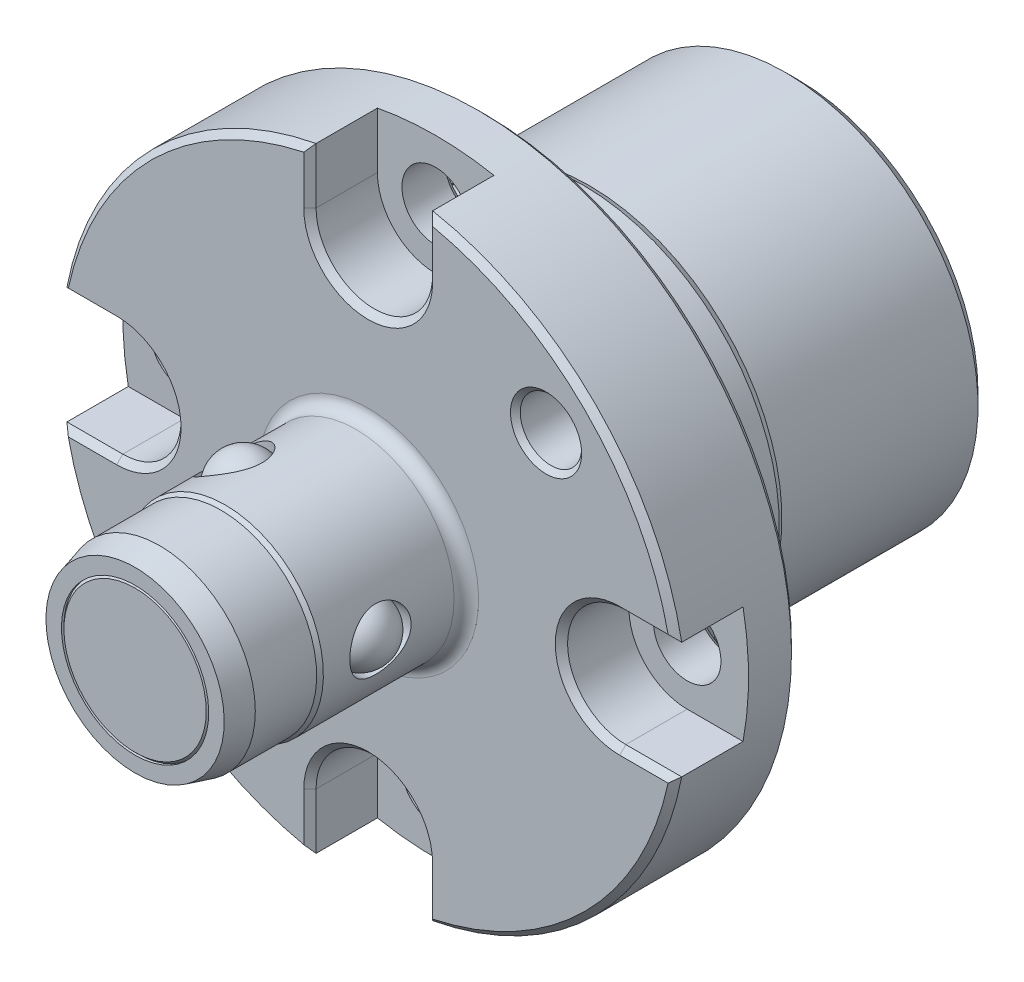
ISO-10303-21;
HEADER;
FILE_DESCRIPTION(('STEP AP214'),'2;1');
FILE_NAME('part.step','',(''),(''),'','','');
FILE_SCHEMA(('AUTOMOTIVE_DESIGN { 1 0 10303 214 1 1 1 1 }'));
ENDSEC;
DATA;
#1=APPLICATION_CONTEXT('core data for automotive mechanical design processes');
#2=APPLICATION_PROTOCOL_DEFINITION('international standard','automotive_design',2000,#1);
#3=PRODUCT_CONTEXT('',#1,'mechanical');
#4=PRODUCT('Part','Part','',(#3));
#5=PRODUCT_RELATED_PRODUCT_CATEGORY('part','',(#4));
#6=PRODUCT_DEFINITION_FORMATION('','',#4);
#7=PRODUCT_DEFINITION_CONTEXT('part definition',#1,'design');
#8=PRODUCT_DEFINITION('design','',#6,#7);
#9=PRODUCT_DEFINITION_SHAPE('','',#8);
#10=(LENGTH_UNIT() NAMED_UNIT(*) SI_UNIT(.MILLI.,.METRE.));
#11=(NAMED_UNIT(*) PLANE_ANGLE_UNIT() SI_UNIT($,.RADIAN.));
#12=(NAMED_UNIT(*) SI_UNIT($,.STERADIAN.) SOLID_ANGLE_UNIT());
#13=UNCERTAINTY_MEASURE_WITH_UNIT(LENGTH_MEASURE(1.E-05),#10,'distance_accuracy_value','');
#14=(GEOMETRIC_REPRESENTATION_CONTEXT(3) GLOBAL_UNCERTAINTY_ASSIGNED_CONTEXT((#13)) GLOBAL_UNIT_ASSIGNED_CONTEXT((#10,
#11,#12)) REPRESENTATION_CONTEXT('',''));
#15=CARTESIAN_POINT('',(0.,0.,0.));
#16=DIRECTION('',(0.,0.,1.));
#17=DIRECTION('',(1.,0.,0.));
#18=AXIS2_PLACEMENT_3D('',#15,#16,#17);
#19=CARTESIAN_POINT('',(0.,0.,-25.5));
#20=DIRECTION('',(0.,0.,-1.));
#21=DIRECTION('',(0.,1.,0.));
#22=AXIS2_PLACEMENT_3D('',#19,#20,#21);
#23=CYLINDRICAL_SURFACE('',#22,7.8);
#24=CARTESIAN_POINT('',(0.,0.,26.5));
#25=DIRECTION('',(0.,0.,1.));
#26=DIRECTION('',(0.,-1.,0.));
#27=AXIS2_PLACEMENT_3D('',#24,#25,#26);
#28=CIRCLE('',#27,7.8);
#29=CARTESIAN_POINT('',(0.,-7.8,26.5));
#30=VERTEX_POINT('',#29);
#31=EDGE_CURVE('E1237',#30,#30,#28,.F.);
#32=ORIENTED_EDGE('',*,*,#31,.T.);
#33=EDGE_LOOP('',(#32));
#34=FACE_BOUND('',#33,.T.);
#35=CARTESIAN_POINT('',(0.,0.,21.5));
#36=DIRECTION('',(0.,0.,-1.));
#37=DIRECTION('',(0.,1.,0.));
#38=AXIS2_PLACEMENT_3D('',#35,#36,#37);
#39=CIRCLE('',#38,7.8);
#40=CARTESIAN_POINT('',(0.,7.8,21.5));
#41=VERTEX_POINT('',#40);
#42=EDGE_CURVE('E1240',#41,#41,#39,.T.);
#43=ORIENTED_EDGE('',*,*,#42,.F.);
#44=EDGE_LOOP('',(#43));
#45=FACE_BOUND('',#44,.T.);
#46=ADVANCED_FACE('F14',(#34,#45),#23,.T.);
#47=CARTESIAN_POINT('',(0.,0.,21.1535898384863));
#48=DIRECTION('',(0.,0.,-1.));
#49=DIRECTION('',(0.,1.,0.));
#50=AXIS2_PLACEMENT_3D('',#47,#48,#49);
#51=CONICAL_SURFACE('',#50,8.,0.523598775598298);
#52=ORIENTED_EDGE('',*,*,#42,.T.);
#53=EDGE_LOOP('',(#52));
#54=FACE_BOUND('',#53,.T.);
#55=CARTESIAN_POINT('',(0.,0.,21.1535898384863));
#56=DIRECTION('',(0.,0.,-1.));
#57=DIRECTION('',(0.,1.,0.));
#58=AXIS2_PLACEMENT_3D('',#55,#56,#57);
#59=CIRCLE('',#58,8.);
#60=CARTESIAN_POINT('',(0.,8.,21.1535898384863));
#61=VERTEX_POINT('',#60);
#62=EDGE_CURVE('E1708',#61,#61,#59,.T.);
#63=ORIENTED_EDGE('',*,*,#62,.F.);
#64=EDGE_LOOP('',(#63));
#65=FACE_BOUND('',#64,.T.);
#66=ADVANCED_FACE('F261',(#54,#65),#51,.T.);
#67=CARTESIAN_POINT('',(0.,0.,26.5));
#68=DIRECTION('',(0.,0.,-1.));
#69=DIRECTION('',(0.,1.,0.));
#70=AXIS2_PLACEMENT_3D('',#67,#68,#69);
#71=CONICAL_SURFACE('',#70,7.8,0.261799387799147);
#72=CARTESIAN_POINT('',(0.,0.,28.5));
#73=DIRECTION('',(0.,0.,1.));
#74=DIRECTION('',(0.,-1.,0.));
#75=AXIS2_PLACEMENT_3D('',#72,#73,#74);
#76=CIRCLE('',#75,7.26410161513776);
#77=CARTESIAN_POINT('',(0.,-7.26410161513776,28.5));
#78=VERTEX_POINT('',#77);
#79=EDGE_CURVE('E1712',#78,#78,#76,.T.);
#80=ORIENTED_EDGE('',*,*,#79,.F.);
#81=EDGE_LOOP('',(#80));
#82=FACE_BOUND('',#81,.T.);
#83=ORIENTED_EDGE('',*,*,#31,.F.);
#84=EDGE_LOOP('',(#83));
#85=FACE_BOUND('',#84,.T.);
#86=ADVANCED_FACE('F283',(#82,#85),#71,.T.);
#87=CARTESIAN_POINT('',(8.,0.,28.5));
#88=DIRECTION('',(0.,0.,1.));
#89=DIRECTION('',(0.,-1.,0.));
#90=AXIS2_PLACEMENT_3D('',#87,#88,#89);
#91=PLANE('',#90);
#92=ORIENTED_EDGE('',*,*,#79,.T.);
#93=EDGE_LOOP('',(#92));
#94=FACE_BOUND('',#93,.T.);
#95=CARTESIAN_POINT('',(0.,0.,28.5));
#96=DIRECTION('',(0.,0.,1.));
#97=DIRECTION('',(0.,-1.,0.));
#98=AXIS2_PLACEMENT_3D('',#95,#96,#97);
#99=CIRCLE('',#98,6.);
#100=CARTESIAN_POINT('',(0.,-6.,28.5));
#101=VERTEX_POINT('',#100);
#102=EDGE_CURVE('E173',#101,#101,#99,.T.);
#103=ORIENTED_EDGE('',*,*,#102,.F.);
#104=EDGE_LOOP('',(#103));
#105=FACE_BOUND('',#104,.T.);
#106=ADVANCED_FACE('F287',(#94,#105),#91,.T.);
#107=CARTESIAN_POINT('',(0.,0.,27.));
#108=DIRECTION('',(0.,0.,1.));
#109=DIRECTION('',(0.,-1.,0.));
#110=AXIS2_PLACEMENT_3D('',#107,#108,#109);
#111=CYLINDRICAL_SURFACE('',#110,6.);
#112=CARTESIAN_POINT('',(0.,0.,28.3));
#113=DIRECTION('',(0.,0.,-1.));
#114=DIRECTION('',(0.,1.,0.));
#115=AXIS2_PLACEMENT_3D('',#112,#113,#114);
#116=CIRCLE('',#115,6.);
#117=CARTESIAN_POINT('',(0.,6.,28.3));
#118=VERTEX_POINT('',#117);
#119=EDGE_CURVE('E1754',#118,#118,#116,.T.);
#120=ORIENTED_EDGE('',*,*,#119,.T.);
#121=EDGE_LOOP('',(#120));
#122=FACE_BOUND('',#121,.T.);
#123=ORIENTED_EDGE('',*,*,#102,.T.);
#124=EDGE_LOOP('',(#123));
#125=FACE_BOUND('',#124,.T.);
#126=ADVANCED_FACE('F198',(#122,#125),#111,.F.);
#127=CARTESIAN_POINT('',(0.,0.,28.5));
#128=DIRECTION('',(0.,0.,-1.));
#129=DIRECTION('',(-1.,0.,0.));
#130=AXIS2_PLACEMENT_3D('',#127,#128,#129);
#131=CONICAL_SURFACE('',#130,5.8,0.78539816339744);
#132=ORIENTED_EDGE('',*,*,#119,.F.);
#133=EDGE_LOOP('',(#132));
#134=FACE_BOUND('',#133,.T.);
#135=CARTESIAN_POINT('',(0.,0.,28.5));
#136=DIRECTION('',(0.,0.,1.));
#137=DIRECTION('',(1.,0.,0.));
#138=AXIS2_PLACEMENT_3D('',#135,#136,#137);
#139=CIRCLE('',#138,5.8);
#140=CARTESIAN_POINT('',(5.8,0.,28.5));
#141=VERTEX_POINT('',#140);
#142=EDGE_CURVE('E113',#141,#141,#139,.T.);
#143=ORIENTED_EDGE('',*,*,#142,.F.);
#144=EDGE_LOOP('',(#143));
#145=FACE_BOUND('',#144,.T.);
#146=ADVANCED_FACE('F212',(#134,#145),#131,.T.);
#147=CARTESIAN_POINT('',(0.,0.,10.5));
#148=DIRECTION('',(0.,0.,1.));
#149=DIRECTION('',(0.,-1.,0.));
#150=AXIS2_PLACEMENT_3D('',#147,#148,#149);
#151=TOROIDAL_SURFACE('',#150,9.,1.);
#152=CARTESIAN_POINT('',(0.,0.,9.5));
#153=DIRECTION('',(0.,0.,1.));
#154=DIRECTION('',(0.,-1.,0.));
#155=AXIS2_PLACEMENT_3D('',#152,#153,#154);
#156=CIRCLE('',#155,9.);
#157=CARTESIAN_POINT('',(0.,-9.,9.5));
#158=VERTEX_POINT('',#157);
#159=EDGE_CURVE('E1677',#158,#158,#156,.F.);
#160=ORIENTED_EDGE('',*,*,#159,.F.);
#161=EDGE_LOOP('',(#160));
#162=FACE_BOUND('',#161,.T.);
#163=CARTESIAN_POINT('',(0.,0.,10.5));
#164=DIRECTION('',(0.,0.,1.));
#165=DIRECTION('',(0.,-1.,0.));
#166=AXIS2_PLACEMENT_3D('',#163,#164,#165);
#167=CIRCLE('',#166,8.);
#168=CARTESIAN_POINT('',(0.,-8.,10.5));
#169=VERTEX_POINT('',#168);
#170=EDGE_CURVE('E1679',#169,#169,#167,.T.);
#171=ORIENTED_EDGE('',*,*,#170,.F.);
#172=EDGE_LOOP('',(#171));
#173=FACE_BOUND('',#172,.T.);
#174=ADVANCED_FACE('F204',(#162,#173),#151,.F.);
#175=CARTESIAN_POINT('',(0.,0.,16.5));
#176=DIRECTION('',(0.5,0.866025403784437,0.));
#177=DIRECTION('',(-0.866025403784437,0.5,0.));
#178=AXIS2_PLACEMENT_3D('',#175,#176,#177);
#179=CYLINDRICAL_SURFACE('',#178,2.5);
#180=CARTESIAN_POINT('',(-3.35,-5.80237020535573,16.5));
#181=DIRECTION('',(-0.5,-0.866025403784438,0.));
#182=DIRECTION('',(0.866025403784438,-0.5,0.));
#183=AXIS2_PLACEMENT_3D('',#180,#181,#182);
#184=CIRCLE('',#183,2.5);
#185=CARTESIAN_POINT('',(-1.18493649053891,-7.05237020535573,16.5));
#186=VERTEX_POINT('',#185);
#187=EDGE_CURVE('E1733',#186,#186,#184,.T.);
#188=ORIENTED_EDGE('',*,*,#187,.F.);
#189=EDGE_LOOP('',(#188));
#190=FACE_BOUND('',#189,.T.);
#191=CARTESIAN_POINT('',(-5.96473454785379,-5.33122329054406,16.5));
#192=CARTESIAN_POINT('',(-5.96473416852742,-5.33122448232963,16.6366940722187));
#193=CARTESIAN_POINT('',(-5.95685671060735,-5.34007692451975,16.7733975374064));
#194=CARTESIAN_POINT('',(-5.92548139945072,-5.37486782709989,17.0427883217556));
#195=CARTESIAN_POINT('',(-5.90197932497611,-5.40081090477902,17.1754745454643));
#196=CARTESIAN_POINT('',(-5.83977914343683,-5.46800265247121,17.432889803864));
#197=CARTESIAN_POINT('',(-5.80110792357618,-5.50922423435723,17.5576324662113));
#198=CARTESIAN_POINT('',(-5.70907702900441,-5.6045349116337,17.796305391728));
#199=CARTESIAN_POINT('',(-5.65571475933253,-5.65862628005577,17.9102337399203));
#200=CARTESIAN_POINT('',(-5.53302119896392,-5.77868955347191,18.127957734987));
#201=CARTESIAN_POINT('',(-5.46324426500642,-5.84497904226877,18.231327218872));
#202=CARTESIAN_POINT('',(-5.30954031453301,-5.9849454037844,18.4211920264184));
#203=CARTESIAN_POINT('',(-5.22561132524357,-6.05862330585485,18.5076849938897));
#204=CARTESIAN_POINT('',(-5.04271165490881,-6.21172914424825,18.6632221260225));
#205=CARTESIAN_POINT('',(-4.94344370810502,-6.29124944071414,18.7318274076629));
#206=CARTESIAN_POINT('',(-4.73319264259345,-6.45091320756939,18.8467520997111));
#207=CARTESIAN_POINT('',(-4.62221228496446,-6.5310565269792,18.8930767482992));
#208=CARTESIAN_POINT('',(-4.3947797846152,-6.68612444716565,18.9607022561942));
#209=CARTESIAN_POINT('',(-4.27860234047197,-6.76113377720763,18.9827314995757));
#210=CARTESIAN_POINT('',(-4.0409634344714,-6.90579072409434,19.003448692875));
#211=CARTESIAN_POINT('',(-3.91950318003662,-6.97543955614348,19.0021419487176));
#212=CARTESIAN_POINT('',(-3.67927685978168,-7.1049923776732,18.9767034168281));
#213=CARTESIAN_POINT('',(-3.5605625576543,-7.1651497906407,18.953361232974));
#214=CARTESIAN_POINT('',(-3.32526284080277,-7.27733644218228,18.885810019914));
#215=CARTESIAN_POINT('',(-3.20867756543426,-7.32936515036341,18.8415996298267));
#216=CARTESIAN_POINT('',(-2.97975856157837,-7.42540563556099,18.7330596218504));
#217=CARTESIAN_POINT('',(-2.86749433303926,-7.46931149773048,18.6684903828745));
#218=CARTESIAN_POINT('',(-2.65214694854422,-7.54846330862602,18.5212578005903));
#219=CARTESIAN_POINT('',(-2.54906612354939,-7.58370706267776,18.4385898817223));
#220=CARTESIAN_POINT('',(-2.35123760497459,-7.64741378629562,18.2534527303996));
#221=CARTESIAN_POINT('',(-2.25701621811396,-7.67553295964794,18.1503018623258));
#222=CARTESIAN_POINT('',(-2.08537569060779,-7.72393561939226,17.9292097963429));
#223=CARTESIAN_POINT('',(-2.00795852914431,-7.74421818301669,17.8112668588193));
#224=CARTESIAN_POINT('',(-1.87230120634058,-7.7781394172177,17.5621650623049));
#225=CARTESIAN_POINT('',(-1.81428513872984,-7.79170126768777,17.4308731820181));
#226=CARTESIAN_POINT('',(-1.72143313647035,-7.8127434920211,17.159881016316));
#227=CARTESIAN_POINT('',(-1.68658887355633,-7.82022605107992,17.0201837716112));
#228=CARTESIAN_POINT('',(-1.6428346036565,-7.82953240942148,16.7423600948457));
#229=CARTESIAN_POINT('',(-1.63293898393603,-7.83157145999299,16.6043960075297));
#230=CARTESIAN_POINT('',(-1.63673570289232,-7.83077917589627,16.3288205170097));
#231=CARTESIAN_POINT('',(-1.65042439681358,-7.82794859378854,16.1912090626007));
#232=CARTESIAN_POINT('',(-1.69992086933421,-7.81734425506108,15.9243834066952));
#233=CARTESIAN_POINT('',(-1.73507759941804,-7.80971580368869,15.7950414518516));
#234=CARTESIAN_POINT('',(-1.82529682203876,-7.78912178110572,15.5439564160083));
#235=CARTESIAN_POINT('',(-1.8803625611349,-7.77615533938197,15.4222145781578));
#236=CARTESIAN_POINT('',(-2.00997517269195,-7.74367954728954,15.1859217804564));
#237=CARTESIAN_POINT('',(-2.08503544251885,-7.72399322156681,15.0716771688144));
#238=CARTESIAN_POINT('',(-2.2509971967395,-7.67726714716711,14.8570193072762));
#239=CARTESIAN_POINT('',(-2.34190279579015,-7.65022548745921,14.7566096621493));
#240=CARTESIAN_POINT('',(-2.54053705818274,-7.58663105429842,14.5681792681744));
#241=CARTESIAN_POINT('',(-2.64880679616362,-7.54973054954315,14.4808444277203));
#242=CARTESIAN_POINT('',(-2.87550494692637,-7.46632684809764,14.3262179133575));
#243=CARTESIAN_POINT('',(-2.9939328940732,-7.41982409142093,14.2589253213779));
#244=CARTESIAN_POINT('',(-3.23606260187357,-7.3174469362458,14.1469388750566));
#245=CARTESIAN_POINT('',(-3.35971883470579,-7.26164445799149,14.1020814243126));
#246=CARTESIAN_POINT('',(-3.60892195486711,-7.14106520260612,14.0358549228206));
#247=CARTESIAN_POINT('',(-3.73446823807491,-7.07629124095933,14.014478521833));
#248=CARTESIAN_POINT('',(-3.97806746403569,-6.94215471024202,13.9964179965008));
#249=CARTESIAN_POINT('',(-4.09621479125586,-6.87309536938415,13.9987430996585));
#250=CARTESIAN_POINT('',(-4.32695830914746,-6.73021874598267,14.0256236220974));
#251=CARTESIAN_POINT('',(-4.43955486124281,-6.65640177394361,14.0501775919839));
#252=CARTESIAN_POINT('',(-4.65493932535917,-6.50757094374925,14.1201880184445));
#253=CARTESIAN_POINT('',(-4.75783229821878,-6.43258360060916,14.1653792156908));
#254=CARTESIAN_POINT('',(-4.95327389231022,-6.28332834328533,14.275141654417));
#255=CARTESIAN_POINT('',(-5.04582073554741,-6.20906055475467,14.3397162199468));
#256=CARTESIAN_POINT('',(-5.22199611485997,-6.06171580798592,14.4889455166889));
#257=CARTESIAN_POINT('',(-5.30521568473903,-5.98876468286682,14.574207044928));
#258=CARTESIAN_POINT('',(-5.45785474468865,-5.84999855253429,14.7613197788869));
#259=CARTESIAN_POINT('',(-5.5272700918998,-5.78418569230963,14.8631759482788));
#260=CARTESIAN_POINT('',(-5.65353063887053,-5.66088767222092,15.0846314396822));
#261=CARTESIAN_POINT('',(-5.70988318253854,-5.60375065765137,15.2047068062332));
#262=CARTESIAN_POINT('',(-5.80622963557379,-5.50386589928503,15.4567962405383));
#263=CARTESIAN_POINT('',(-5.846230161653,-5.46111233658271,15.5888054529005));
#264=CARTESIAN_POINT('',(-5.90661586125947,-5.39571155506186,15.8494452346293));
#265=CARTESIAN_POINT('',(-5.92838210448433,-5.37166141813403,15.9774050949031));
#266=CARTESIAN_POINT('',(-5.95743984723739,-5.33941866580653,16.236907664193));
#267=CARTESIAN_POINT('',(-5.96473491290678,-5.33122214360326,16.368449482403));
#268=CARTESIAN_POINT('',(-5.96473454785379,-5.33122329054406,16.5));
#269=B_SPLINE_CURVE_WITH_KNOTS('',3,(#191,#192,#193,#194,#195,#196,#197,#198,#199,#200,#201,
#202,#203,#204,#205,#206,#207,#208,#209,#210,#211,#212,#213,#214,#215,#216,#217,#218,#219,#220,
#221,#222,#223,#224,#225,#226,#227,#228,#229,#230,#231,#232,#233,#234,#235,#236,#237,#238,#239,
#240,#241,#242,#243,#244,#245,#246,#247,#248,#249,#250,#251,#252,#253,#254,#255,#256,#257,#258,
#259,#260,#261,#262,#263,#264,#265,#266,#267,#268),.UNSPECIFIED.,.T.,.F.,(4,2,2,2,2,2,2,2,2,2,2,
2,2,2,2,2,2,2,2,2,2,2,2,2,2,2,2,2,2,2,2,2,2,2,2,2,2,2,4),(0.,0.409596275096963,
0.819303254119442,1.22828728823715,1.63734360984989,2.05914161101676,2.48099845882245,
2.91239643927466,3.34369294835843,3.76167445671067,4.17956092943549,4.58301965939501,
4.98650470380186,5.39492809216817,5.80345485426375,6.22900677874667,6.65460879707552,
7.08496941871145,7.51517527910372,7.92809866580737,8.34095824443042,8.7418794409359,
9.14286604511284,9.55535226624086,9.96794576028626,10.3976387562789,10.8273120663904,
11.2538047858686,11.6801639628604,12.0887760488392,12.4973614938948,12.9008369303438,
13.3043815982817,13.721613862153,14.1389711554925,14.5701559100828,15.0011660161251,
15.3954470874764,15.7896309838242),.UNSPECIFIED.);
#270=CARTESIAN_POINT('',(-5.96473454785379,-5.33122329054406,16.5));
#271=VERTEX_POINT('',#270);
#272=EDGE_CURVE('E172',#271,#271,#269,.T.);
#273=ORIENTED_EDGE('',*,*,#272,.F.);
#274=EDGE_LOOP('',(#273));
#275=FACE_BOUND('',#274,.T.);
#276=ADVANCED_FACE('F200',(#190,#275),#179,.F.);
#277=CARTESIAN_POINT('',(-3.35,-5.80237020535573,16.5));
#278=DIRECTION('',(-0.5,-0.866025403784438,0.));
#279=DIRECTION('',(0.866025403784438,-0.5,0.));
#280=AXIS2_PLACEMENT_3D('',#277,#278,#279);
#281=PLANE('',#280);
#282=CARTESIAN_POINT('',(-3.35,-5.80237020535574,16.5));
#283=DIRECTION('',(-0.5,-0.866025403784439,0.));
#284=DIRECTION('',(0.866025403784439,-0.5,0.));
#285=AXIS2_PLACEMENT_3D('',#282,#283,#284);
#286=CIRCLE('',#285,2.4678973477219);
#287=CARTESIAN_POINT('',(-1.2127382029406,-7.03631887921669,16.5));
#288=VERTEX_POINT('',#287);
#289=EDGE_CURVE('E18',#288,#288,#286,.T.);
#290=ORIENTED_EDGE('',*,*,#289,.F.);
#291=EDGE_LOOP('',(#290));
#292=FACE_BOUND('',#291,.T.);
#293=ORIENTED_EDGE('',*,*,#187,.T.);
#294=EDGE_LOOP('',(#293));
#295=FACE_BOUND('',#294,.T.);
#296=ADVANCED_FACE('F166',(#292,#295),#281,.T.);
#297=CARTESIAN_POINT('',(0.,0.,16.5));
#298=DIRECTION('',(0.499999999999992,-0.866025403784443,0.));
#299=DIRECTION('',(0.866025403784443,0.499999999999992,0.));
#300=AXIS2_PLACEMENT_3D('',#297,#298,#299);
#301=CYLINDRICAL_SURFACE('',#300,2.5);
#302=CARTESIAN_POINT('',(-3.34999999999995,5.80237020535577,16.5));
#303=DIRECTION('',(-0.5,0.866025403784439,0.));
#304=DIRECTION('',(-0.866025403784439,-0.5,0.));
#305=AXIS2_PLACEMENT_3D('',#302,#303,#304);
#306=CIRCLE('',#305,2.5);
#307=CARTESIAN_POINT('',(-5.51506350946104,4.55237020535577,16.5));
#308=VERTEX_POINT('',#307);
#309=EDGE_CURVE('E9',#308,#308,#306,.T.);
#310=ORIENTED_EDGE('',*,*,#309,.F.);
#311=EDGE_LOOP('',(#310));
#312=FACE_BOUND('',#311,.T.);
#313=CARTESIAN_POINT('',(-1.63460752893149,7.83122329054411,16.5));
#314=CARTESIAN_POINT('',(-1.63460875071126,7.83122355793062,16.6366940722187));
#315=CARTESIAN_POINT('',(-1.64621391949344,7.82882770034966,16.7733975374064));
#316=CARTESIAN_POINT('',(-1.69203138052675,7.81905133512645,17.0427883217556));
#317=CARTESIAN_POINT('',(-1.72624978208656,7.81166948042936,17.1754745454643));
#318=CARTESIAN_POINT('',(-1.81553963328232,7.79139841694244,17.432889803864));
#319=CARTESIAN_POINT('',(-1.87057418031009,7.7785189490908,17.5576324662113));
#320=CARTESIAN_POINT('',(-1.9991310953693,7.74647319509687,17.796305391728));
#321=CARTESIAN_POINT('',(-2.07265672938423,7.72730579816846,17.9102337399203));
#322=CARTESIAN_POINT('',(-2.23798135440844,7.68108169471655,18.127957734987));
#323=CARTESIAN_POINT('',(-2.33027820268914,7.6537978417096,18.231327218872));
#324=CARTESIAN_POINT('',(-2.52834460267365,7.59066949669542,18.4211920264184));
#325=CARTESIAN_POINT('',(-2.63411603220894,7.55482381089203,18.5076849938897));
#326=CARTESIAN_POINT('',(-2.85815941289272,7.47298096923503,18.6632221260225));
#327=CARTESIAN_POINT('',(-2.97665998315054,7.42677255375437,18.7318274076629));
#328=CARTESIAN_POINT('',(-3.22005839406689,7.32452167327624,18.8467520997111));
#329=CARTESIAN_POINT('',(-3.3449547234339,7.26848152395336,18.8930767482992));
#330=CARTESIAN_POINT('',(-3.59296373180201,7.1490531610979,18.9607022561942));
#331=CARTESIAN_POINT('',(-3.71601243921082,7.08594520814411,18.9827314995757));
#332=CARTESIAN_POINT('',(-3.9601084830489,6.95247235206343,19.003448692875));
#333=CARTESIAN_POINT('',(-4.08115626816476,6.88210910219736,19.0021419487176));
#334=CARTESIAN_POINT('',(-4.31346546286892,6.73884341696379,18.9767034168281));
#335=CARTESIAN_POINT('',(-4.42492046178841,6.66611252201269,18.953361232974));
#336=CARTESIAN_POINT('',(-4.6397268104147,6.51843031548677,18.885810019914));
#337=CARTESIAN_POINT('',(-4.74307763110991,6.443478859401,18.8415996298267));
#338=CARTESIAN_POINT('',(-4.94071063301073,6.29324942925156,18.7330596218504));
#339=CARTESIAN_POINT('',(-5.03486633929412,6.21797868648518,18.6684903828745));
#340=CARTESIAN_POINT('',(-5.21108751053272,6.07105828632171,18.5212578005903));
#341=CARTESIAN_POINT('',(-5.29314990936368,5.999409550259,18.4385898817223));
#342=CARTESIAN_POINT('',(-5.44723580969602,5.85993838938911,18.2534527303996));
#343=CARTESIAN_POINT('',(-5.51869842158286,5.79239986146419,18.1503018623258));
#344=CARTESIAN_POINT('',(-5.64643661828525,5.66795613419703,17.9292097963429));
#345=CARTESIAN_POINT('',(-5.70271041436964,5.61105218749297,17.8112668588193));
#346=CARTESIAN_POINT('',(-5.7999157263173,5.51053011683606,17.5621650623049));
#347=CARTESIAN_POINT('',(-5.84066866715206,5.46706765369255,17.4308731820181));
#348=CARTESIAN_POINT('',(-5.9053177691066,5.39717657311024,17.159881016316));
#349=CARTESIAN_POINT('',(-5.92921998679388,5.37074183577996,17.0201837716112));
#350=CARTESIAN_POINT('',(-5.9591566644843,5.33750270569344,16.7423600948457));
#351=CARTESIAN_POINT('',(-5.96587034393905,5.3299523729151,16.6043960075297));
#352=CARTESIAN_POINT('',(-5.96328584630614,5.33284428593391,16.3288205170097));
#353=CARTESIAN_POINT('',(-5.95399014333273,5.34328375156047,16.1912090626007));
#354=CARTESIAN_POINT('',(-5.92005828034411,5.38084678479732,15.9243834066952));
#355=CARTESIAN_POINT('',(-5.89587348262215,5.40747918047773,15.7950414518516));
#356=CARTESIAN_POINT('',(-5.83292892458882,5.47531430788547,15.5439564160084));
#357=CARTESIAN_POINT('',(-5.79416678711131,5.51651941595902,15.4222145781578));
#358=CARTESIAN_POINT('',(-5.70123562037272,5.61252933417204,15.1859217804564));
#359=CARTESIAN_POINT('',(-5.6466566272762,5.6676902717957,15.0716771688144));
#360=CARTESIAN_POINT('',(-5.52320978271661,5.78805432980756,14.8570193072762));
#361=CARTESIAN_POINT('',(-5.45433821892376,5.85326005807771,14.7566096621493));
#362=CARTESIAN_POINT('',(-5.29994669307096,5.99348515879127,14.5681792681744));
#363=CARTESIAN_POINT('',(-5.21385504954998,6.06879924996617,14.4808444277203));
#364=CARTESIAN_POINT('',(-5.02827624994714,6.2234237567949,14.3262179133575));
#365=CARTESIAN_POINT('',(-4.92878970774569,6.30273398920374,14.2589253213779));
#366=CARTESIAN_POINT('',(-4.71906363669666,6.4612358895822,14.1469388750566));
#367=CARTESIAN_POINT('',(-4.60890915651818,6.54042408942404,14.1020814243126));
#368=CARTESIAN_POINT('',(-4.37988289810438,6.6959506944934,14.0358549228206));
#369=CARTESIAN_POINT('',(-4.2610138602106,6.77228998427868,14.014478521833));
#370=CARTESIAN_POINT('',(-4.02304860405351,6.91618483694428,13.9964179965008));
#371=CARTESIAN_POINT('',(-3.90416779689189,6.98397375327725,13.9987430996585));
#372=CARTESIAN_POINT('',(-3.66506125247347,7.11236518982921,14.0256236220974));
#373=CARTESIAN_POINT('',(-3.54483560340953,7.1729681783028,14.0501775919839));
#374=CARTESIAN_POINT('',(-3.3082520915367,7.28508118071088,14.1201880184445));
#375=CARTESIAN_POINT('',(-3.19186466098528,7.33669543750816,14.1653792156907));
#376=CARTESIAN_POINT('',(-2.96488501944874,7.43132519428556,14.2751416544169));
#377=CARTESIAN_POINT('',(-2.85429380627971,7.47433921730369,14.3397162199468));
#378=CARTESIAN_POINT('',(-2.6386018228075,7.55323919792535,14.4889455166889));
#379=CARTESIAN_POINT('',(-2.53381451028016,7.58883389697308,14.5742070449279));
#380=CARTESIAN_POINT('',(-2.33731998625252,7.65164013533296,14.7613197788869));
#381=CARTESIAN_POINT('',(-2.24561670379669,7.678849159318,14.8631759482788));
#382=CARTESIAN_POINT('',(-2.07570721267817,7.72654499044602,15.0846314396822));
#383=CARTESIAN_POINT('',(-1.99804883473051,7.74677921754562,15.2047068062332));
#384=CARTESIAN_POINT('',(-1.86337287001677,7.7802753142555,15.4567962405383));
#385=CARTESIAN_POINT('',(-1.80634693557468,7.79354000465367,15.5888054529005));
#386=CARTESIAN_POINT('',(-1.71951534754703,7.81313516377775,15.8494452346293));
#387=CARTESIAN_POINT('',(-1.68780419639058,7.81996021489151,15.9774050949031));
#388=CARTESIAN_POINT('',(-1.64535228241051,7.82900358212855,16.236907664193));
#389=CARTESIAN_POINT('',(-1.63460635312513,7.83122303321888,16.368449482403));
#390=CARTESIAN_POINT('',(-1.63460752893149,7.83122329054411,16.5));
#391=B_SPLINE_CURVE_WITH_KNOTS('',3,(#313,#314,#315,#316,#317,#318,#319,#320,#321,#322,#323,
#324,#325,#326,#327,#328,#329,#330,#331,#332,#333,#334,#335,#336,#337,#338,#339,#340,#341,#342,
#343,#344,#345,#346,#347,#348,#349,#350,#351,#352,#353,#354,#355,#356,#357,#358,#359,#360,#361,
#362,#363,#364,#365,#366,#367,#368,#369,#370,#371,#372,#373,#374,#375,#376,#377,#378,#379,#380,
#381,#382,#383,#384,#385,#386,#387,#388,#389,#390),.UNSPECIFIED.,.T.,.F.,(4,2,2,2,2,2,2,2,2,2,2,
2,2,2,2,2,2,2,2,2,2,2,2,2,2,2,2,2,2,2,2,2,2,2,2,2,2,2,4),(0.,0.409596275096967,
0.819303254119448,1.22828728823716,1.6373436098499,2.05914161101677,2.48099845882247,
2.91239643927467,3.34369294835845,3.76167445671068,4.1795609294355,4.58301965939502,
4.98650470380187,5.39492809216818,5.80345485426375,6.22900677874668,6.65460879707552,
7.08496941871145,7.51517527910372,7.92809866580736,8.34095824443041,8.74187944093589,
9.14286604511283,9.55535226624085,9.96794576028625,10.3976387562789,10.8273120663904,
11.2538047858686,11.6801639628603,12.0887760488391,12.4973614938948,12.9008369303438,
13.3043815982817,13.721613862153,14.1389711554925,14.5701559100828,15.0011660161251,
15.3954470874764,15.7896309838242),.UNSPECIFIED.);
#392=CARTESIAN_POINT('',(-1.63460752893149,7.83122329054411,16.5));
#393=VERTEX_POINT('',#392);
#394=EDGE_CURVE('E170',#393,#393,#391,.T.);
#395=ORIENTED_EDGE('',*,*,#394,.F.);
#396=EDGE_LOOP('',(#395));
#397=FACE_BOUND('',#396,.T.);
#398=ADVANCED_FACE('F160',(#312,#397),#301,.F.);
#399=CARTESIAN_POINT('',(0.,0.,-25.5));
#400=DIRECTION('',(0.,0.,-1.));
#401=DIRECTION('',(0.,1.,0.));
#402=AXIS2_PLACEMENT_3D('',#399,#400,#401);
#403=CYLINDRICAL_SURFACE('',#402,8.);
#404=ORIENTED_EDGE('',*,*,#62,.T.);
#405=EDGE_LOOP('',(#404));
#406=FACE_BOUND('',#405,.T.);
#407=ORIENTED_EDGE('',*,*,#170,.T.);
#408=EDGE_LOOP('',(#407));
#409=FACE_BOUND('',#408,.T.);
#410=ORIENTED_EDGE('',*,*,#272,.T.);
#411=EDGE_LOOP('',(#410));
#412=FACE_BOUND('',#411,.T.);
#413=CARTESIAN_POINT('',(7.59934207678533,-2.5,16.5));
#414=CARTESIAN_POINT('',(7.59934291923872,-2.49999907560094,16.6366940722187));
#415=CARTESIAN_POINT('',(7.60307063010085,-2.48875077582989,16.7733975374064));
#416=CARTESIAN_POINT('',(7.61751277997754,-2.44418350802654,17.0427883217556));
#417=CARTESIAN_POINT('',(7.62822910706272,-2.4108585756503,17.1754745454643));
#418=CARTESIAN_POINT('',(7.6553187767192,-2.32339576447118,17.432889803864));
#419=CARTESIAN_POINT('',(7.67168210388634,-2.26929471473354,17.5576324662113));
#420=CARTESIAN_POINT('',(7.70820812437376,-2.14193828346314,17.796305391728));
#421=CARTESIAN_POINT('',(7.7283714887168,-2.06867951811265,17.9102337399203));
#422=CARTESIAN_POINT('',(7.77100255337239,-1.90239214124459,18.127957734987));
#423=CARTESIAN_POINT('',(7.79352246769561,-1.80881879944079,18.231327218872));
#424=CARTESIAN_POINT('',(7.83788491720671,-1.60572409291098,18.4211920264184));
#425=CARTESIAN_POINT('',(7.85972735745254,-1.49620050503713,18.5076849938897));
#426=CARTESIAN_POINT('',(7.90087106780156,-1.26125182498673,18.6632221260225));
#427=CARTESIAN_POINT('',(7.9201036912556,-1.13552311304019,18.7318274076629));
#428=CARTESIAN_POINT('',(7.95325103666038,-0.873608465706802,18.8467520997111));
#429=CARTESIAN_POINT('',(7.9671670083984,-0.737424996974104,18.8930767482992));
#430=CARTESIAN_POINT('',(7.98774351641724,-0.462928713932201,18.9607022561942));
#431=CARTESIAN_POINT('',(7.99461477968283,-0.324811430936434,18.9827314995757));
#432=CARTESIAN_POINT('',(8.00107191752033,-0.0466816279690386,19.003448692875));
#433=CARTESIAN_POINT('',(8.00065944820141,0.0933304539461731,19.0021419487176));
#434=CARTESIAN_POINT('',(7.99274232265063,0.366148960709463,18.9767034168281));
#435=CARTESIAN_POINT('',(7.98548301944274,0.499037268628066,18.953361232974));
#436=CARTESIAN_POINT('',(7.9649896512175,0.758906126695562,18.885810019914));
#437=CARTESIAN_POINT('',(7.95175519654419,0.885886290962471,18.8415996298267));
#438=CARTESIAN_POINT('',(7.92046919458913,1.13215620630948,18.7330596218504));
#439=CARTESIAN_POINT('',(7.90236067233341,1.25133281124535,18.6684903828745));
#440=CARTESIAN_POINT('',(7.86323445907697,1.47740502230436,18.5212578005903));
#441=CARTESIAN_POINT('',(7.84221603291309,1.58429751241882,18.4385898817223));
#442=CARTESIAN_POINT('',(7.79847341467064,1.78747539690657,18.2534527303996));
#443=CARTESIAN_POINT('',(7.77571463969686,1.88313309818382,18.1503018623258));
#444=CARTESIAN_POINT('',(7.73181230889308,2.05597948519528,17.9292097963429));
#445=CARTESIAN_POINT('',(7.71066894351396,2.13316599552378,17.8112668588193));
#446=CARTESIAN_POINT('',(7.67221693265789,2.26760930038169,17.5621650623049));
#447=CARTESIAN_POINT('',(7.65495380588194,2.32463361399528,17.4308731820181));
#448=CARTESIAN_POINT('',(7.62675090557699,2.41556691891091,17.159881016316));
#449=CARTESIAN_POINT('',(7.61580886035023,2.44948421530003,17.0201837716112));
#450=CARTESIAN_POINT('',(7.60199126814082,2.4920297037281,16.7423600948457));
#451=CARTESIAN_POINT('',(7.59880932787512,2.50161908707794,16.6043960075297));
#452=CARTESIAN_POINT('',(7.6000215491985,2.49793488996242,16.3288205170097));
#453=CARTESIAN_POINT('',(7.60441454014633,2.48466484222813,16.1912090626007));
#454=CARTESIAN_POINT('',(7.61997914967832,2.43649747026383,15.9243834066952));
#455=CARTESIAN_POINT('',(7.63095108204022,2.40223662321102,15.7950414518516));
#456=CARTESIAN_POINT('',(7.65822574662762,2.3138074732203,15.5439564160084));
#457=CARTESIAN_POINT('',(7.67452934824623,2.25963592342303,15.4222145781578));
#458=CARTESIAN_POINT('',(7.71121079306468,2.13115021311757,15.1859217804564));
#459=CARTESIAN_POINT('',(7.73169206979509,2.05630294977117,15.0716771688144));
#460=CARTESIAN_POINT('',(7.77420697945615,1.88921281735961,14.8570193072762));
#461=CARTESIAN_POINT('',(7.79624101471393,1.79696542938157,14.7566096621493));
#462=CARTESIAN_POINT('',(7.8404837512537,1.59314589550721,14.5681792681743));
#463=CARTESIAN_POINT('',(7.86266184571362,1.48093129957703,14.4808444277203));
#464=CARTESIAN_POINT('',(7.90378119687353,1.24290309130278,14.3262179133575));
#465=CARTESIAN_POINT('',(7.92272260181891,1.11709010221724,14.2589253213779));
#466=CARTESIAN_POINT('',(7.95512623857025,0.856211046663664,14.1469388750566));
#467=CARTESIAN_POINT('',(7.968627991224,0.72122036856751,14.1020814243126));
#468=CARTESIAN_POINT('',(7.98880485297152,0.445114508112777,14.0358549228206));
#469=CARTESIAN_POINT('',(7.99548209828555,0.304001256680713,14.014478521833));
#470=CARTESIAN_POINT('',(8.00111606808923,0.0259698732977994,13.9964179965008));
#471=CARTESIAN_POINT('',(8.00038258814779,-0.110878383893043,13.9987430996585));
#472=CARTESIAN_POINT('',(7.99201956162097,-0.382146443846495,14.0256236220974));
#473=CARTESIAN_POINT('',(7.98439046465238,-0.516566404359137,14.0501775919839));
#474=CARTESIAN_POINT('',(7.96319141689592,-0.77751023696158,14.1201880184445));
#475=CARTESIAN_POINT('',(7.94969695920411,-0.904111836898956,14.1653792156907));
#476=CARTESIAN_POINT('',(7.918158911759,-1.14799685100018,14.275141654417));
#477=CARTESIAN_POINT('',(7.90011454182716,-1.26527866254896,14.3397162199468));
#478=CARTESIAN_POINT('',(7.86059793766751,-1.49152338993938,14.4889455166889));
#479=CARTESIAN_POINT('',(7.83903019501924,-1.60006921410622,14.5742070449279));
#480=CARTESIAN_POINT('',(7.79517473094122,-1.80164158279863,14.7613197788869));
#481=CARTESIAN_POINT('',(7.77288679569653,-1.89466346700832,14.8631759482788));
#482=CARTESIAN_POINT('',(7.72923785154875,-2.06565731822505,15.0846314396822));
#483=CARTESIAN_POINT('',(7.70793201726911,-2.14302855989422,15.2047068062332));
#484=CARTESIAN_POINT('',(7.66960250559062,-2.27640941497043,15.4567962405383));
#485=CARTESIAN_POINT('',(7.65257709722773,-2.33242766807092,15.5888054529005));
#486=CARTESIAN_POINT('',(7.62613120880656,-2.41742360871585,15.8494452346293));
#487=CARTESIAN_POINT('',(7.61618630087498,-2.44829879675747,15.9774050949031));
#488=CARTESIAN_POINT('',(7.60279212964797,-2.48958491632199,16.236907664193));
#489=CARTESIAN_POINT('',(7.59934126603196,-2.50000088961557,16.368449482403));
#490=CARTESIAN_POINT('',(7.59934207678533,-2.5,16.5));
#491=B_SPLINE_CURVE_WITH_KNOTS('',3,(#413,#414,#415,#416,#417,#418,#419,#420,#421,#422,#423,
#424,#425,#426,#427,#428,#429,#430,#431,#432,#433,#434,#435,#436,#437,#438,#439,#440,#441,#442,
#443,#444,#445,#446,#447,#448,#449,#450,#451,#452,#453,#454,#455,#456,#457,#458,#459,#460,#461,
#462,#463,#464,#465,#466,#467,#468,#469,#470,#471,#472,#473,#474,#475,#476,#477,#478,#479,#480,
#481,#482,#483,#484,#485,#486,#487,#488,#489,#490),.UNSPECIFIED.,.T.,.F.,(4,2,2,2,2,2,2,2,2,2,2,
2,2,2,2,2,2,2,2,2,2,2,2,2,2,2,2,2,2,2,2,2,2,2,2,2,2,2,4),(0.,0.409596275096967,
0.819303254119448,1.22828728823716,1.6373436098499,2.05914161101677,2.48099845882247,
2.91239643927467,3.34369294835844,3.76167445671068,4.1795609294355,4.58301965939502,
4.98650470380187,5.39492809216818,5.80345485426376,6.22900677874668,6.65460879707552,
7.08496941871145,7.51517527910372,7.92809866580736,8.34095824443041,8.74187944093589,
9.14286604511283,9.55535226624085,9.96794576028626,10.3976387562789,10.8273120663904,
11.2538047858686,11.6801639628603,12.0887760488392,12.4973614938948,12.9008369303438,
13.3043815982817,13.721613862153,14.1389711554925,14.5701559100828,15.0011660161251,
15.3954470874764,15.7896309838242),.UNSPECIFIED.);
#492=CARTESIAN_POINT('',(7.59934207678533,-2.5,16.5));
#493=VERTEX_POINT('',#492);
#494=EDGE_CURVE('E176',#493,#493,#491,.T.);
#495=ORIENTED_EDGE('',*,*,#494,.T.);
#496=EDGE_LOOP('',(#495));
#497=FACE_BOUND('',#496,.T.);
#498=ORIENTED_EDGE('',*,*,#394,.T.);
#499=EDGE_LOOP('',(#498));
#500=FACE_BOUND('',#499,.T.);
#501=ADVANCED_FACE('F165',(#406,#409,#412,#497,#500),#403,.T.);
#502=CARTESIAN_POINT('',(0.,0.,16.5));
#503=DIRECTION('',(-1.,0.,0.));
#504=DIRECTION('',(0.,-1.,0.));
#505=AXIS2_PLACEMENT_3D('',#502,#503,#504);
#506=CYLINDRICAL_SURFACE('',#505,2.5);
#507=CARTESIAN_POINT('',(6.7,0.,16.5));
#508=DIRECTION('',(1.,0.,0.));
#509=DIRECTION('',(0.,1.,0.));
#510=AXIS2_PLACEMENT_3D('',#507,#508,#509);
#511=CIRCLE('',#510,2.5);
#512=CARTESIAN_POINT('',(6.7,2.5,16.5));
#513=VERTEX_POINT('',#512);
#514=EDGE_CURVE('E339',#513,#513,#511,.T.);
#515=ORIENTED_EDGE('',*,*,#514,.F.);
#516=EDGE_LOOP('',(#515));
#517=FACE_BOUND('',#516,.T.);
#518=ORIENTED_EDGE('',*,*,#494,.F.);
#519=EDGE_LOOP('',(#518));
#520=FACE_BOUND('',#519,.T.);
#521=ADVANCED_FACE('F206',(#517,#520),#506,.F.);
#522=CARTESIAN_POINT('',(6.7,0.,16.5));
#523=DIRECTION('',(1.,0.,0.));
#524=DIRECTION('',(0.,1.,0.));
#525=AXIS2_PLACEMENT_3D('',#522,#523,#524);
#526=PLANE('',#525);
#527=CARTESIAN_POINT('',(6.7,0.,16.5));
#528=DIRECTION('',(1.,0.,0.));
#529=DIRECTION('',(0.,1.,0.));
#530=AXIS2_PLACEMENT_3D('',#527,#528,#529);
#531=CIRCLE('',#530,2.4678973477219);
#532=CARTESIAN_POINT('',(6.7,2.4678973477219,16.5));
#533=VERTEX_POINT('',#532);
#534=EDGE_CURVE('E1752',#533,#533,#531,.T.);
#535=ORIENTED_EDGE('',*,*,#534,.F.);
#536=EDGE_LOOP('',(#535));
#537=FACE_BOUND('',#536,.T.);
#538=ORIENTED_EDGE('',*,*,#514,.T.);
#539=EDGE_LOOP('',(#538));
#540=FACE_BOUND('',#539,.T.);
#541=ADVANCED_FACE('F210',(#537,#540),#526,.T.);
#542=CARTESIAN_POINT('',(0.,0.,28.5));
#543=DIRECTION('',(0.,0.,1.));
#544=DIRECTION('',(1.,0.,0.));
#545=AXIS2_PLACEMENT_3D('',#542,#543,#544);
#546=PLANE('',#545);
#547=ORIENTED_EDGE('',*,*,#142,.T.);
#548=EDGE_LOOP('',(#547));
#549=FACE_BOUND('',#548,.T.);
#550=ADVANCED_FACE('F307',(#549),#546,.T.);
#551=CARTESIAN_POINT('',(-9.5,0.,-20.));
#552=DIRECTION('',(0.,0.,1.));
#553=DIRECTION('',(0.,-1.,0.));
#554=AXIS2_PLACEMENT_3D('',#551,#552,#553);
#555=PLANE('',#554);
#556=CARTESIAN_POINT('',(0.,0.,-20.));
#557=DIRECTION('',(0.,0.,1.));
#558=DIRECTION('',(0.,-1.,0.));
#559=AXIS2_PLACEMENT_3D('',#556,#557,#558);
#560=CIRCLE('',#559,9.5);
#561=CARTESIAN_POINT('',(0.,-9.5,-20.));
#562=VERTEX_POINT('',#561);
#563=EDGE_CURVE('E139',#562,#562,#560,.T.);
#564=ORIENTED_EDGE('',*,*,#563,.F.);
#565=EDGE_LOOP('',(#564));
#566=FACE_BOUND('',#565,.T.);
#567=ADVANCED_FACE('F310',(#566),#555,.F.);
#568=CARTESIAN_POINT('',(0.,0.,-20.));
#569=DIRECTION('',(0.,0.,-1.));
#570=DIRECTION('',(0.,1.,0.));
#571=AXIS2_PLACEMENT_3D('',#568,#569,#570);
#572=CONICAL_SURFACE('',#571,9.5,0.785398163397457);
#573=CARTESIAN_POINT('',(0.,0.,-20.5));
#574=DIRECTION('',(0.,0.,1.));
#575=DIRECTION('',(0.,-1.,0.));
#576=AXIS2_PLACEMENT_3D('',#573,#574,#575);
#577=CIRCLE('',#576,10.);
#578=CARTESIAN_POINT('',(0.,-10.,-20.5));
#579=VERTEX_POINT('',#578);
#580=EDGE_CURVE('E140',#579,#579,#577,.T.);
#581=ORIENTED_EDGE('',*,*,#580,.F.);
#582=EDGE_LOOP('',(#581));
#583=FACE_BOUND('',#582,.T.);
#584=ORIENTED_EDGE('',*,*,#563,.T.);
#585=EDGE_LOOP('',(#584));
#586=FACE_BOUND('',#585,.T.);
#587=ADVANCED_FACE('F393',(#583,#586),#572,.F.);
#588=CARTESIAN_POINT('',(0.,0.,-20.5));
#589=DIRECTION('',(0.,0.,1.));
#590=DIRECTION('',(0.,-1.,0.));
#591=AXIS2_PLACEMENT_3D('',#588,#589,#590);
#592=PLANE('',#591);
#593=ORIENTED_EDGE('',*,*,#580,.T.);
#594=EDGE_LOOP('',(#593));
#595=FACE_BOUND('',#594,.T.);
#596=CARTESIAN_POINT('',(0.,0.,-20.5));
#597=DIRECTION('',(0.,0.,1.));
#598=DIRECTION('',(0.,-1.,0.));
#599=AXIS2_PLACEMENT_3D('',#596,#597,#598);
#600=CIRCLE('',#599,13.);
#601=CARTESIAN_POINT('',(0.,-13.,-20.5));
#602=VERTEX_POINT('',#601);
#603=EDGE_CURVE('E146',#602,#602,#600,.T.);
#604=ORIENTED_EDGE('',*,*,#603,.F.);
#605=EDGE_LOOP('',(#604));
#606=FACE_BOUND('',#605,.T.);
#607=ADVANCED_FACE('F389',(#595,#606),#592,.F.);
#608=CARTESIAN_POINT('',(0.,0.,-25.5));
#609=DIRECTION('',(0.,0.,-1.));
#610=DIRECTION('',(0.,1.,0.));
#611=AXIS2_PLACEMENT_3D('',#608,#609,#610);
#612=CYLINDRICAL_SURFACE('',#611,13.);
#613=ORIENTED_EDGE('',*,*,#603,.T.);
#614=EDGE_LOOP('',(#613));
#615=FACE_BOUND('',#614,.T.);
#616=CARTESIAN_POINT('',(0.,0.,-22.25));
#617=DIRECTION('',(0.,0.,-1.));
#618=DIRECTION('',(0.,1.,0.));
#619=AXIS2_PLACEMENT_3D('',#616,#617,#618);
#620=CIRCLE('',#619,13.);
#621=CARTESIAN_POINT('',(0.,13.,-22.25));
#622=VERTEX_POINT('',#621);
#623=EDGE_CURVE('E1658',#622,#622,#620,.T.);
#624=ORIENTED_EDGE('',*,*,#623,.T.);
#625=EDGE_LOOP('',(#624));
#626=FACE_BOUND('',#625,.T.);
#627=ADVANCED_FACE('F392',(#615,#626),#612,.F.);
#628=CARTESIAN_POINT('',(13.,0.,-22.25));
#629=DIRECTION('',(0.,0.,1.));
#630=DIRECTION('',(0.,-1.,0.));
#631=AXIS2_PLACEMENT_3D('',#628,#629,#630);
#632=PLANE('',#631);
#633=ORIENTED_EDGE('',*,*,#623,.F.);
#634=EDGE_LOOP('',(#633));
#635=FACE_BOUND('',#634,.T.);
#636=CARTESIAN_POINT('',(0.,0.,-22.25));
#637=DIRECTION('',(0.,0.,-1.));
#638=DIRECTION('',(0.,1.,0.));
#639=AXIS2_PLACEMENT_3D('',#636,#637,#638);
#640=CIRCLE('',#639,13.6);
#641=CARTESIAN_POINT('',(0.,13.6,-22.25));
#642=VERTEX_POINT('',#641);
#643=EDGE_CURVE('E1655',#642,#642,#640,.T.);
#644=ORIENTED_EDGE('',*,*,#643,.T.);
#645=EDGE_LOOP('',(#644));
#646=FACE_BOUND('',#645,.T.);
#647=ADVANCED_FACE('F402',(#635,#646),#632,.F.);
#648=CARTESIAN_POINT('',(0.,-0.75,-22.4));
#649=DIRECTION('',(0.,0.,-1.));
#650=DIRECTION('',(-1.,0.,0.));
#651=AXIS2_PLACEMENT_3D('',#648,#649,#650);
#652=PLANE('',#651);
#653=CARTESIAN_POINT('',(-3.7,-11.165302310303,-22.4));
#654=DIRECTION('',(0.,0.,1.));
#655=DIRECTION('',(1.,0.,0.));
#656=AXIS2_PLACEMENT_3D('',#653,#654,#655);
#657=CIRCLE('',#656,1.);
#658=CARTESIAN_POINT('',(-2.7,-11.165302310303,-22.4));
#659=VERTEX_POINT('',#658);
#660=EDGE_CURVE('E108',#659,#659,#657,.F.);
#661=ORIENTED_EDGE('',*,*,#660,.T.);
#662=EDGE_LOOP('',(#661));
#663=FACE_BOUND('',#662,.T.);
#664=CARTESIAN_POINT('',(3.7,-11.165302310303,-22.4));
#665=DIRECTION('',(0.,0.,1.));
#666=DIRECTION('',(1.,0.,0.));
#667=AXIS2_PLACEMENT_3D('',#664,#665,#666);
#668=CIRCLE('',#667,1.);
#669=CARTESIAN_POINT('',(4.7,-11.165302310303,-22.4));
#670=VERTEX_POINT('',#669);
#671=EDGE_CURVE('E128',#670,#670,#668,.F.);
#672=ORIENTED_EDGE('',*,*,#671,.T.);
#673=EDGE_LOOP('',(#672));
#674=FACE_BOUND('',#673,.T.);
#675=CARTESIAN_POINT('',(0.,0.,-22.4));
#676=DIRECTION('',(0.,0.,1.));
#677=DIRECTION('',(1.,0.,0.));
#678=AXIS2_PLACEMENT_3D('',#675,#676,#677);
#679=CIRCLE('',#678,13.6);
#680=CARTESIAN_POINT('',(2.1813307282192,-13.4239262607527,-22.4));
#681=VERTEX_POINT('',#680);
#682=CARTESIAN_POINT('',(-2.18133072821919,-13.4239262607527,-22.4));
#683=VERTEX_POINT('',#682);
#684=EDGE_CURVE('E32',#681,#683,#679,.T.);
#685=ORIENTED_EDGE('',*,*,#684,.T.);
#686=DIRECTION('',(-0.231349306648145,-0.97287075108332,0.));
#687=VECTOR('',#686,1.);
#688=CARTESIAN_POINT('',(-1.75425849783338,-11.6280009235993,-22.4));
#689=LINE('',#688,#687);
#690=CARTESIAN_POINT('',(-1.75425849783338,-11.6280009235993,-22.4));
#691=VERTEX_POINT('',#690);
#692=EDGE_CURVE('E75',#683,#691,#689,.F.);
#693=ORIENTED_EDGE('',*,*,#692,.T.);
#694=CARTESIAN_POINT('',(-3.7,-11.165302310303,-22.4));
#695=DIRECTION('',(0.,0.,1.));
#696=DIRECTION('',(1.,0.,0.));
#697=AXIS2_PLACEMENT_3D('',#694,#695,#696);
#698=CIRCLE('',#697,2.);
#699=CARTESIAN_POINT('',(-4.74866968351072,-9.46227797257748,-22.4));
#700=VERTEX_POINT('',#699);
#701=EDGE_CURVE('E78',#700,#691,#698,.F.);
#702=ORIENTED_EDGE('',*,*,#701,.F.);
#703=DIRECTION('',(0.851512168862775,0.524334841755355,0.));
#704=VECTOR('',#703,1.);
#705=CARTESIAN_POINT('',(-4.74866968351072,-9.46227797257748,-22.4));
#706=LINE('',#705,#704);
#707=CARTESIAN_POINT('',(-6.45127454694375,-10.5106893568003,-22.4));
#708=VERTEX_POINT('',#707);
#709=EDGE_CURVE('E72',#700,#708,#706,.F.);
#710=ORIENTED_EDGE('',*,*,#709,.T.);
#711=CARTESIAN_POINT('',(0.,-0.75,-22.4));
#712=DIRECTION('',(0.,0.,1.));
#713=DIRECTION('',(1.,0.,0.));
#714=AXIS2_PLACEMENT_3D('',#711,#712,#713);
#715=CIRCLE('',#714,11.7);
#716=CARTESIAN_POINT('',(6.45127454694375,-10.5106893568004,-22.4));
#717=VERTEX_POINT('',#716);
#718=EDGE_CURVE('E132',#708,#717,#715,.F.);
#719=ORIENTED_EDGE('',*,*,#718,.T.);
#720=DIRECTION('',(0.851512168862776,-0.524334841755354,0.));
#721=VECTOR('',#720,1.);
#722=CARTESIAN_POINT('',(4.74866968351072,-9.46227797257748,-22.4));
#723=LINE('',#722,#721);
#724=CARTESIAN_POINT('',(4.74866968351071,-9.46227797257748,-22.4));
#725=VERTEX_POINT('',#724);
#726=EDGE_CURVE('E104',#717,#725,#723,.F.);
#727=ORIENTED_EDGE('',*,*,#726,.T.);
#728=CARTESIAN_POINT('',(3.7,-11.165302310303,-22.4));
#729=DIRECTION('',(0.,0.,1.));
#730=DIRECTION('',(1.,0.,0.));
#731=AXIS2_PLACEMENT_3D('',#728,#729,#730);
#732=CIRCLE('',#731,2.);
#733=CARTESIAN_POINT('',(1.75425849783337,-11.6280009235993,-22.4));
#734=VERTEX_POINT('',#733);
#735=EDGE_CURVE('E107',#734,#725,#732,.F.);
#736=ORIENTED_EDGE('',*,*,#735,.F.);
#737=DIRECTION('',(-0.231349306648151,0.972870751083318,0.));
#738=VECTOR('',#737,1.);
#739=CARTESIAN_POINT('',(1.75425849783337,-11.6280009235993,-22.4));
#740=LINE('',#739,#738);
#741=EDGE_CURVE('E96',#734,#681,#740,.F.);
#742=ORIENTED_EDGE('',*,*,#741,.T.);
#743=EDGE_LOOP('',(#685,#693,#702,#710,#719,#727,#736,#742));
#744=FACE_BOUND('',#743,.T.);
#745=ADVANCED_FACE('F77',(#663,#674,#744),#652,.F.);
#746=CARTESIAN_POINT('',(-3.7,-11.165302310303,-22.4));
#747=DIRECTION('',(0.,0.,1.));
#748=DIRECTION('',(1.,0.,0.));
#749=AXIS2_PLACEMENT_3D('',#746,#747,#748);
#750=CYLINDRICAL_SURFACE('',#749,2.);
#751=ORIENTED_EDGE('',*,*,#701,.T.);
#752=DIRECTION('',(0.,0.,1.));
#753=VECTOR('',#752,1.);
#754=CARTESIAN_POINT('',(-1.75425849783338,-11.6280009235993,-22.4));
#755=LINE('',#754,#753);
#756=CARTESIAN_POINT('',(-1.75425849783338,-11.6280009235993,-23.6));
#757=VERTEX_POINT('',#756);
#758=EDGE_CURVE('E83',#691,#757,#755,.F.);
#759=ORIENTED_EDGE('',*,*,#758,.T.);
#760=CARTESIAN_POINT('',(-3.7,-11.165302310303,-23.6));
#761=DIRECTION('',(0.,0.,1.));
#762=DIRECTION('',(1.,0.,0.));
#763=AXIS2_PLACEMENT_3D('',#760,#761,#762);
#764=CIRCLE('',#763,2.);
#765=CARTESIAN_POINT('',(-4.74866968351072,-9.46227797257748,-23.6));
#766=VERTEX_POINT('',#765);
#767=EDGE_CURVE('E122',#766,#757,#764,.F.);
#768=ORIENTED_EDGE('',*,*,#767,.F.);
#769=DIRECTION('',(0.,0.,1.));
#770=VECTOR('',#769,1.);
#771=CARTESIAN_POINT('',(-4.74866968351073,-9.46227797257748,-22.4));
#772=LINE('',#771,#770);
#773=EDGE_CURVE('E89',#766,#700,#772,.T.);
#774=ORIENTED_EDGE('',*,*,#773,.T.);
#775=EDGE_LOOP('',(#751,#759,#768,#774));
#776=FACE_BOUND('',#775,.T.);
#777=ADVANCED_FACE('F86',(#776),#750,.T.);
#778=CARTESIAN_POINT('',(-4.74866968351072,-9.46227797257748,-22.4));
#779=DIRECTION('',(0.524334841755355,-0.851512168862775,0.));
#780=DIRECTION('',(0.851512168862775,0.524334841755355,0.));
#781=AXIS2_PLACEMENT_3D('',#778,#779,#780);
#782=PLANE('',#781);
#783=DIRECTION('',(0.,0.,1.));
#784=VECTOR('',#783,1.);
#785=CARTESIAN_POINT('',(-6.45127454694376,-10.5106893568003,-22.4));
#786=LINE('',#785,#784);
#787=CARTESIAN_POINT('',(-6.45127454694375,-10.5106893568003,-23.6));
#788=VERTEX_POINT('',#787);
#789=EDGE_CURVE('E134',#788,#708,#786,.T.);
#790=ORIENTED_EDGE('',*,*,#789,.T.);
#791=ORIENTED_EDGE('',*,*,#709,.F.);
#792=ORIENTED_EDGE('',*,*,#773,.F.);
#793=DIRECTION('',(0.851512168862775,0.524334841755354,0.));
#794=VECTOR('',#793,1.);
#795=CARTESIAN_POINT('',(-6.45127454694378,-10.5106893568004,-23.6));
#796=LINE('',#795,#794);
#797=EDGE_CURVE('E124',#788,#766,#796,.T.);
#798=ORIENTED_EDGE('',*,*,#797,.F.);
#799=EDGE_LOOP('',(#790,#791,#792,#798));
#800=FACE_BOUND('',#799,.T.);
#801=ADVANCED_FACE('F372',(#800),#782,.F.);
#802=CARTESIAN_POINT('',(0.,-0.75,-22.4));
#803=DIRECTION('',(0.,0.,1.));
#804=DIRECTION('',(1.,0.,0.));
#805=AXIS2_PLACEMENT_3D('',#802,#803,#804);
#806=CYLINDRICAL_SURFACE('',#805,11.7);
#807=DIRECTION('',(0.,0.,1.));
#808=VECTOR('',#807,1.);
#809=CARTESIAN_POINT('',(6.45127454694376,-10.5106893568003,-22.4));
#810=LINE('',#809,#808);
#811=CARTESIAN_POINT('',(6.45127454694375,-10.5106893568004,-23.6));
#812=VERTEX_POINT('',#811);
#813=EDGE_CURVE('E131',#717,#812,#810,.F.);
#814=ORIENTED_EDGE('',*,*,#813,.F.);
#815=ORIENTED_EDGE('',*,*,#718,.F.);
#816=ORIENTED_EDGE('',*,*,#789,.F.);
#817=CARTESIAN_POINT('',(0.,-0.75,-23.6));
#818=DIRECTION('',(0.,0.,1.));
#819=DIRECTION('',(1.,0.,0.));
#820=AXIS2_PLACEMENT_3D('',#817,#818,#819);
#821=CIRCLE('',#820,11.7);
#822=EDGE_CURVE('E114',#812,#788,#821,.T.);
#823=ORIENTED_EDGE('',*,*,#822,.F.);
#824=EDGE_LOOP('',(#814,#815,#816,#823));
#825=FACE_BOUND('',#824,.T.);
#826=ADVANCED_FACE('F370',(#825),#806,.F.);
#827=CARTESIAN_POINT('',(4.74866968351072,-9.46227797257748,-22.4));
#828=DIRECTION('',(-0.524334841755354,-0.851512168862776,0.));
#829=DIRECTION('',(0.851512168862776,-0.524334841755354,0.));
#830=AXIS2_PLACEMENT_3D('',#827,#828,#829);
#831=PLANE('',#830);
#832=DIRECTION('',(0.,0.,1.));
#833=VECTOR('',#832,1.);
#834=CARTESIAN_POINT('',(4.74866968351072,-9.46227797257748,-22.4));
#835=LINE('',#834,#833);
#836=CARTESIAN_POINT('',(4.74866968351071,-9.46227797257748,-23.6));
#837=VERTEX_POINT('',#836);
#838=EDGE_CURVE('E106',#725,#837,#835,.F.);
#839=ORIENTED_EDGE('',*,*,#838,.F.);
#840=ORIENTED_EDGE('',*,*,#726,.F.);
#841=ORIENTED_EDGE('',*,*,#813,.T.);
#842=DIRECTION('',(0.851512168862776,-0.524334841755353,0.));
#843=VECTOR('',#842,1.);
#844=CARTESIAN_POINT('',(4.74866968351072,-9.46227797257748,-23.6));
#845=LINE('',#844,#843);
#846=EDGE_CURVE('E117',#837,#812,#845,.T.);
#847=ORIENTED_EDGE('',*,*,#846,.F.);
#848=EDGE_LOOP('',(#839,#840,#841,#847));
#849=FACE_BOUND('',#848,.T.);
#850=ADVANCED_FACE('F353',(#849),#831,.F.);
#851=CARTESIAN_POINT('',(3.7,-11.165302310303,-22.4));
#852=DIRECTION('',(0.,0.,1.));
#853=DIRECTION('',(1.,0.,0.));
#854=AXIS2_PLACEMENT_3D('',#851,#852,#853);
#855=CYLINDRICAL_SURFACE('',#854,2.);
#856=ORIENTED_EDGE('',*,*,#735,.T.);
#857=ORIENTED_EDGE('',*,*,#838,.T.);
#858=CARTESIAN_POINT('',(3.7,-11.165302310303,-23.6));
#859=DIRECTION('',(0.,0.,1.));
#860=DIRECTION('',(1.,0.,0.));
#861=AXIS2_PLACEMENT_3D('',#858,#859,#860);
#862=CIRCLE('',#861,2.);
#863=CARTESIAN_POINT('',(1.75425849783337,-11.6280009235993,-23.6));
#864=VERTEX_POINT('',#863);
#865=EDGE_CURVE('E118',#864,#837,#862,.F.);
#866=ORIENTED_EDGE('',*,*,#865,.F.);
#867=DIRECTION('',(0.,0.,1.));
#868=VECTOR('',#867,1.);
#869=CARTESIAN_POINT('',(1.75425849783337,-11.6280009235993,-22.4));
#870=LINE('',#869,#868);
#871=EDGE_CURVE('E98',#864,#734,#870,.T.);
#872=ORIENTED_EDGE('',*,*,#871,.T.);
#873=EDGE_LOOP('',(#856,#857,#866,#872));
#874=FACE_BOUND('',#873,.T.);
#875=ADVANCED_FACE('F348',(#874),#855,.T.);
#876=CARTESIAN_POINT('',(-3.7,-11.165302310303,-22.4));
#877=DIRECTION('',(0.,0.,1.));
#878=DIRECTION('',(1.,0.,0.));
#879=AXIS2_PLACEMENT_3D('',#876,#877,#878);
#880=CYLINDRICAL_SURFACE('',#879,1.);
#881=CARTESIAN_POINT('',(-3.7,-11.165302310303,-23.6));
#882=DIRECTION('',(0.,0.,1.));
#883=DIRECTION('',(1.,0.,0.));
#884=AXIS2_PLACEMENT_3D('',#881,#882,#883);
#885=CIRCLE('',#884,1.);
#886=CARTESIAN_POINT('',(-2.7,-11.165302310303,-23.6));
#887=VERTEX_POINT('',#886);
#888=EDGE_CURVE('E125',#887,#887,#885,.T.);
#889=ORIENTED_EDGE('',*,*,#888,.F.);
#890=EDGE_LOOP('',(#889));
#891=FACE_BOUND('',#890,.T.);
#892=ORIENTED_EDGE('',*,*,#660,.F.);
#893=EDGE_LOOP('',(#892));
#894=FACE_BOUND('',#893,.T.);
#895=ADVANCED_FACE('F404',(#891,#894),#880,.F.);
#896=CARTESIAN_POINT('',(3.7,-11.165302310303,-22.4));
#897=DIRECTION('',(0.,0.,1.));
#898=DIRECTION('',(1.,0.,0.));
#899=AXIS2_PLACEMENT_3D('',#896,#897,#898);
#900=CYLINDRICAL_SURFACE('',#899,1.);
#901=CARTESIAN_POINT('',(3.7,-11.165302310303,-23.6));
#902=DIRECTION('',(0.,0.,1.));
#903=DIRECTION('',(1.,0.,0.));
#904=AXIS2_PLACEMENT_3D('',#901,#902,#903);
#905=CIRCLE('',#904,1.);
#906=CARTESIAN_POINT('',(4.7,-11.165302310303,-23.6));
#907=VERTEX_POINT('',#906);
#908=EDGE_CURVE('E110',#907,#907,#905,.T.);
#909=ORIENTED_EDGE('',*,*,#908,.F.);
#910=EDGE_LOOP('',(#909));
#911=FACE_BOUND('',#910,.T.);
#912=ORIENTED_EDGE('',*,*,#671,.F.);
#913=EDGE_LOOP('',(#912));
#914=FACE_BOUND('',#913,.T.);
#915=ADVANCED_FACE('F406',(#911,#914),#900,.F.);
#916=CARTESIAN_POINT('',(1.75425849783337,-11.6280009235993,-22.4));
#917=DIRECTION('',(0.972870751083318,0.231349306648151,0.));
#918=DIRECTION('',(-0.231349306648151,0.972870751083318,0.));
#919=AXIS2_PLACEMENT_3D('',#916,#917,#918);
#920=PLANE('',#919);
#921=DIRECTION('',(0.,0.,1.));
#922=VECTOR('',#921,1.);
#923=CARTESIAN_POINT('',(2.1813307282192,-13.4239262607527,-23.6));
#924=LINE('',#923,#922);
#925=CARTESIAN_POINT('',(2.1813307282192,-13.4239262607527,-23.6));
#926=VERTEX_POINT('',#925);
#927=EDGE_CURVE('E329',#681,#926,#924,.F.);
#928=ORIENTED_EDGE('',*,*,#927,.F.);
#929=ORIENTED_EDGE('',*,*,#741,.F.);
#930=ORIENTED_EDGE('',*,*,#871,.F.);
#931=DIRECTION('',(-0.231349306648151,0.972870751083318,0.));
#932=VECTOR('',#931,1.);
#933=CARTESIAN_POINT('',(2.26251017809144,-13.765302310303,-23.6));
#934=LINE('',#933,#932);
#935=CARTESIAN_POINT('',(2.04213989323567,-12.8386005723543,-23.6));
#936=VERTEX_POINT('',#935);
#937=EDGE_CURVE('E121',#936,#864,#934,.T.);
#938=ORIENTED_EDGE('',*,*,#937,.F.);
#939=EDGE_CURVE('E336',#926,#936,#934,.T.);
#940=ORIENTED_EDGE('',*,*,#939,.F.);
#941=EDGE_LOOP('',(#928,#929,#930,#938,#940));
#942=FACE_BOUND('',#941,.T.);
#943=ADVANCED_FACE('F367',(#942),#920,.F.);
#944=CARTESIAN_POINT('',(0.,0.,-25.5));
#945=DIRECTION('',(0.,0.,-1.));
#946=DIRECTION('',(0.,1.,0.));
#947=AXIS2_PLACEMENT_3D('',#944,#945,#946);
#948=CYLINDRICAL_SURFACE('',#947,13.6);
#949=ORIENTED_EDGE('',*,*,#643,.F.);
#950=EDGE_LOOP('',(#949));
#951=FACE_BOUND('',#950,.T.);
#952=CARTESIAN_POINT('',(0.,0.,-23.6));
#953=DIRECTION('',(0.,0.,-1.));
#954=DIRECTION('',(0.,1.,0.));
#955=AXIS2_PLACEMENT_3D('',#952,#953,#954);
#956=CIRCLE('',#955,13.6);
#957=CARTESIAN_POINT('',(-2.18133072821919,-13.4239262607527,-23.6));
#958=VERTEX_POINT('',#957);
#959=EDGE_CURVE('E1653',#926,#958,#956,.T.);
#960=ORIENTED_EDGE('',*,*,#959,.T.);
#961=DIRECTION('',(0.,0.,1.));
#962=VECTOR('',#961,1.);
#963=CARTESIAN_POINT('',(-2.18133072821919,-13.4239262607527,-23.6));
#964=LINE('',#963,#962);
#965=EDGE_CURVE('E149',#958,#683,#964,.T.);
#966=ORIENTED_EDGE('',*,*,#965,.T.);
#967=ORIENTED_EDGE('',*,*,#684,.F.);
#968=ORIENTED_EDGE('',*,*,#927,.T.);
#969=EDGE_LOOP('',(#960,#966,#967,#968));
#970=FACE_BOUND('',#969,.T.);
#971=ADVANCED_FACE('F430',(#951,#970),#948,.F.);
#972=CARTESIAN_POINT('',(-1.75425849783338,-11.6280009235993,-22.4));
#973=DIRECTION('',(-0.97287075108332,0.231349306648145,0.));
#974=DIRECTION('',(-0.231349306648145,-0.97287075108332,0.));
#975=AXIS2_PLACEMENT_3D('',#972,#973,#974);
#976=PLANE('',#975);
#977=ORIENTED_EDGE('',*,*,#965,.F.);
#978=DIRECTION('',(-0.231349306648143,-0.97287075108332,0.));
#979=VECTOR('',#978,1.);
#980=CARTESIAN_POINT('',(-1.75425849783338,-11.6280009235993,-23.6));
#981=LINE('',#980,#979);
#982=CARTESIAN_POINT('',(-2.04213989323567,-12.8386005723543,-23.6));
#983=VERTEX_POINT('',#982);
#984=EDGE_CURVE('E332',#983,#958,#981,.T.);
#985=ORIENTED_EDGE('',*,*,#984,.F.);
#986=EDGE_CURVE('E94',#757,#983,#981,.T.);
#987=ORIENTED_EDGE('',*,*,#986,.F.);
#988=ORIENTED_EDGE('',*,*,#758,.F.);
#989=ORIENTED_EDGE('',*,*,#692,.F.);
#990=EDGE_LOOP('',(#977,#985,#987,#988,#989));
#991=FACE_BOUND('',#990,.T.);
#992=ADVANCED_FACE('F91',(#991),#976,.F.);
#993=CARTESIAN_POINT('',(0.,-0.75,-23.6));
#994=DIRECTION('',(0.,0.,-1.));
#995=DIRECTION('',(-1.,0.,0.));
#996=AXIS2_PLACEMENT_3D('',#993,#994,#995);
#997=PLANE('',#996);
#998=ORIENTED_EDGE('',*,*,#908,.T.);
#999=EDGE_LOOP('',(#998));
#1000=FACE_BOUND('',#999,.T.);
#1001=ORIENTED_EDGE('',*,*,#888,.T.);
#1002=EDGE_LOOP('',(#1001));
#1003=FACE_BOUND('',#1002,.T.);
#1004=CARTESIAN_POINT('',(0.,0.,-23.6));
#1005=DIRECTION('',(0.,0.,-1.));
#1006=DIRECTION('',(0.,1.,0.));
#1007=AXIS2_PLACEMENT_3D('',#1004,#1005,#1006);
#1008=CIRCLE('',#1007,13.);
#1009=EDGE_CURVE('E362',#983,#936,#1008,.T.);
#1010=ORIENTED_EDGE('',*,*,#1009,.T.);
#1011=ORIENTED_EDGE('',*,*,#937,.T.);
#1012=ORIENTED_EDGE('',*,*,#865,.T.);
#1013=ORIENTED_EDGE('',*,*,#846,.T.);
#1014=ORIENTED_EDGE('',*,*,#822,.T.);
#1015=ORIENTED_EDGE('',*,*,#797,.T.);
#1016=ORIENTED_EDGE('',*,*,#767,.T.);
#1017=ORIENTED_EDGE('',*,*,#986,.T.);
#1018=EDGE_LOOP('',(#1010,#1011,#1012,#1013,#1014,#1015,#1016,#1017));
#1019=FACE_BOUND('',#1018,.T.);
#1020=ADVANCED_FACE('F322',(#1000,#1003,#1019),#997,.T.);
#1021=CARTESIAN_POINT('',(13.6,0.,-23.6));
#1022=DIRECTION('',(0.,0.,-1.));
#1023=DIRECTION('',(0.,1.,0.));
#1024=AXIS2_PLACEMENT_3D('',#1021,#1022,#1023);
#1025=PLANE('',#1024);
#1026=EDGE_CURVE('E1654',#936,#983,#1008,.T.);
#1027=ORIENTED_EDGE('',*,*,#1026,.T.);
#1028=ORIENTED_EDGE('',*,*,#984,.T.);
#1029=ORIENTED_EDGE('',*,*,#959,.F.);
#1030=ORIENTED_EDGE('',*,*,#939,.T.);
#1031=EDGE_LOOP('',(#1027,#1028,#1029,#1030));
#1032=FACE_BOUND('',#1031,.T.);
#1033=ADVANCED_FACE('F422',(#1032),#1025,.F.);
#1034=ORIENTED_EDGE('',*,*,#1026,.F.);
#1035=ORIENTED_EDGE('',*,*,#1009,.F.);
#1036=EDGE_LOOP('',(#1034,#1035));
#1037=FACE_BOUND('',#1036,.T.);
#1038=CARTESIAN_POINT('',(0.,0.,-25.));
#1039=DIRECTION('',(0.,0.,-1.));
#1040=DIRECTION('',(0.,1.,0.));
#1041=AXIS2_PLACEMENT_3D('',#1038,#1039,#1040);
#1042=CIRCLE('',#1041,13.);
#1043=CARTESIAN_POINT('',(0.,13.,-25.));
#1044=VERTEX_POINT('',#1043);
#1045=EDGE_CURVE('E1727',#1044,#1044,#1042,.T.);
#1046=ORIENTED_EDGE('',*,*,#1045,.T.);
#1047=EDGE_LOOP('',(#1046));
#1048=FACE_BOUND('',#1047,.T.);
#1049=ADVANCED_FACE('F213',(#1037,#1048),#612,.F.);
#1050=CARTESIAN_POINT('',(0.,0.,-25.));
#1051=DIRECTION('',(0.,0.,-1.));
#1052=DIRECTION('',(0.,1.,0.));
#1053=AXIS2_PLACEMENT_3D('',#1050,#1051,#1052);
#1054=CONICAL_SURFACE('',#1053,13.,0.785398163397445);
#1055=CARTESIAN_POINT('',(0.,0.,-25.5));
#1056=DIRECTION('',(0.,0.,-1.));
#1057=DIRECTION('',(0.,1.,0.));
#1058=AXIS2_PLACEMENT_3D('',#1055,#1056,#1057);
#1059=CIRCLE('',#1058,13.5);
#1060=CARTESIAN_POINT('',(0.,13.5,-25.5));
#1061=VERTEX_POINT('',#1060);
#1062=EDGE_CURVE('E1730',#1061,#1061,#1059,.F.);
#1063=ORIENTED_EDGE('',*,*,#1062,.F.);
#1064=EDGE_LOOP('',(#1063));
#1065=FACE_BOUND('',#1064,.T.);
#1066=ORIENTED_EDGE('',*,*,#1045,.F.);
#1067=EDGE_LOOP('',(#1066));
#1068=FACE_BOUND('',#1067,.T.);
#1069=ADVANCED_FACE('F300',(#1065,#1068),#1054,.F.);
#1070=CARTESIAN_POINT('',(4.15,0.,-25.5));
#1071=DIRECTION('',(0.,0.,-1.));
#1072=DIRECTION('',(0.,1.,0.));
#1073=AXIS2_PLACEMENT_3D('',#1070,#1071,#1072);
#1074=PLANE('',#1073);
#1075=ORIENTED_EDGE('',*,*,#1062,.T.);
#1076=EDGE_LOOP('',(#1075));
#1077=FACE_BOUND('',#1076,.T.);
#1078=CARTESIAN_POINT('',(0.,0.,-25.5));
#1079=DIRECTION('',(0.,0.,-1.));
#1080=DIRECTION('',(0.,1.,0.));
#1081=AXIS2_PLACEMENT_3D('',#1078,#1079,#1080);
#1082=CIRCLE('',#1081,14.7);
#1083=CARTESIAN_POINT('',(0.,14.7,-25.5));
#1084=VERTEX_POINT('',#1083);
#1085=EDGE_CURVE('E191',#1084,#1084,#1082,.T.);
#1086=ORIENTED_EDGE('',*,*,#1085,.T.);
#1087=EDGE_LOOP('',(#1086));
#1088=FACE_BOUND('',#1087,.T.);
#1089=ADVANCED_FACE('F256',(#1077,#1088),#1074,.T.);
#1090=CARTESIAN_POINT('',(0.,0.,-25.5));
#1091=DIRECTION('',(0.,0.,1.));
#1092=DIRECTION('',(0.,-1.,0.));
#1093=AXIS2_PLACEMENT_3D('',#1090,#1091,#1092);
#1094=CONICAL_SURFACE('',#1093,14.7,0.78539816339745);
#1095=CARTESIAN_POINT('',(0.,0.,-24.5));
#1096=DIRECTION('',(0.,0.,-1.));
#1097=DIRECTION('',(0.,1.,0.));
#1098=AXIS2_PLACEMENT_3D('',#1095,#1096,#1097);
#1099=CIRCLE('',#1098,15.7);
#1100=CARTESIAN_POINT('',(0.,15.7,-24.5));
#1101=VERTEX_POINT('',#1100);
#1102=EDGE_CURVE('E1685',#1101,#1101,#1099,.F.);
#1103=ORIENTED_EDGE('',*,*,#1102,.F.);
#1104=EDGE_LOOP('',(#1103));
#1105=FACE_BOUND('',#1104,.T.);
#1106=ORIENTED_EDGE('',*,*,#1085,.F.);
#1107=EDGE_LOOP('',(#1106));
#1108=FACE_BOUND('',#1107,.T.);
#1109=ADVANCED_FACE('F252',(#1105,#1108),#1094,.T.);
#1110=CARTESIAN_POINT('',(0.,0.,-25.5));
#1111=DIRECTION('',(0.,0.,-1.));
#1112=DIRECTION('',(0.,1.,0.));
#1113=AXIS2_PLACEMENT_3D('',#1110,#1111,#1112);
#1114=CYLINDRICAL_SURFACE('',#1113,15.7);
#1115=ORIENTED_EDGE('',*,*,#1102,.T.);
#1116=EDGE_LOOP('',(#1115));
#1117=FACE_BOUND('',#1116,.T.);
#1118=CARTESIAN_POINT('',(0.,0.,-8.51961524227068));
#1119=DIRECTION('',(0.,0.,-1.));
#1120=DIRECTION('',(0.,1.,0.));
#1121=AXIS2_PLACEMENT_3D('',#1118,#1119,#1120);
#1122=CIRCLE('',#1121,15.7);
#1123=CARTESIAN_POINT('',(0.,15.7,-8.51961524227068));
#1124=VERTEX_POINT('',#1123);
#1125=EDGE_CURVE('E179',#1124,#1124,#1122,.T.);
#1126=ORIENTED_EDGE('',*,*,#1125,.T.);
#1127=EDGE_LOOP('',(#1126));
#1128=FACE_BOUND('',#1127,.T.);
#1129=ADVANCED_FACE('F255',(#1117,#1128),#1114,.T.);
#1130=CARTESIAN_POINT('',(0.,0.,-8.51961524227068));
#1131=DIRECTION('',(0.,0.,1.));
#1132=DIRECTION('',(0.,-1.,0.));
#1133=AXIS2_PLACEMENT_3D('',#1130,#1131,#1132);
#1134=CONICAL_SURFACE('',#1133,15.7,0.523598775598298);
#1135=CARTESIAN_POINT('',(0.,0.,-8.));
#1136=DIRECTION('',(0.,0.,-1.));
#1137=DIRECTION('',(0.,1.,0.));
#1138=AXIS2_PLACEMENT_3D('',#1135,#1136,#1137);
#1139=CIRCLE('',#1138,16.);
#1140=CARTESIAN_POINT('',(0.,16.,-8.));
#1141=VERTEX_POINT('',#1140);
#1142=EDGE_CURVE('E1241',#1141,#1141,#1139,.T.);
#1143=ORIENTED_EDGE('',*,*,#1142,.T.);
#1144=EDGE_LOOP('',(#1143));
#1145=FACE_BOUND('',#1144,.T.);
#1146=ORIENTED_EDGE('',*,*,#1125,.F.);
#1147=EDGE_LOOP('',(#1146));
#1148=FACE_BOUND('',#1147,.T.);
#1149=ADVANCED_FACE('F542',(#1145,#1148),#1134,.T.);
#1150=CARTESIAN_POINT('',(0.,0.,-25.5));
#1151=DIRECTION('',(0.,0.,-1.));
#1152=DIRECTION('',(0.,1.,0.));
#1153=AXIS2_PLACEMENT_3D('',#1150,#1151,#1152);
#1154=CYLINDRICAL_SURFACE('',#1153,16.);
#1155=CARTESIAN_POINT('',(0.,0.,-5.5));
#1156=DIRECTION('',(0.,0.,1.));
#1157=DIRECTION('',(0.,-1.,0.));
#1158=AXIS2_PLACEMENT_3D('',#1155,#1156,#1157);
#1159=CIRCLE('',#1158,16.);
#1160=CARTESIAN_POINT('',(0.,-16.,-5.5));
#1161=VERTEX_POINT('',#1160);
#1162=EDGE_CURVE('E1715',#1161,#1161,#1159,.F.);
#1163=ORIENTED_EDGE('',*,*,#1162,.T.);
#1164=EDGE_LOOP('',(#1163));
#1165=FACE_BOUND('',#1164,.T.);
#1166=ORIENTED_EDGE('',*,*,#1142,.F.);
#1167=EDGE_LOOP('',(#1166));
#1168=FACE_BOUND('',#1167,.T.);
#1169=ADVANCED_FACE('F293',(#1165,#1168),#1154,.T.);
#1170=CARTESIAN_POINT('',(0.,0.,-5.5));
#1171=DIRECTION('',(0.,0.,-1.));
#1172=DIRECTION('',(0.,1.,0.));
#1173=AXIS2_PLACEMENT_3D('',#1170,#1171,#1172);
#1174=CONICAL_SURFACE('',#1173,16.,0.785398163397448);
#1175=CARTESIAN_POINT('',(0.,0.,-5.2));
#1176=DIRECTION('',(0.,0.,1.));
#1177=DIRECTION('',(0.,-1.,0.));
#1178=AXIS2_PLACEMENT_3D('',#1175,#1176,#1177);
#1179=CIRCLE('',#1178,15.7);
#1180=CARTESIAN_POINT('',(0.,-15.7,-5.2));
#1181=VERTEX_POINT('',#1180);
#1182=EDGE_CURVE('E1718',#1181,#1181,#1179,.T.);
#1183=ORIENTED_EDGE('',*,*,#1182,.F.);
#1184=EDGE_LOOP('',(#1183));
#1185=FACE_BOUND('',#1184,.T.);
#1186=ORIENTED_EDGE('',*,*,#1162,.F.);
#1187=EDGE_LOOP('',(#1186));
#1188=FACE_BOUND('',#1187,.T.);
#1189=ADVANCED_FACE('F289',(#1185,#1188),#1174,.T.);
#1190=CARTESIAN_POINT('',(-14.5,0.,-5.2));
#1191=DIRECTION('',(0.,0.,1.));
#1192=DIRECTION('',(0.,-1.,0.));
#1193=AXIS2_PLACEMENT_3D('',#1190,#1191,#1192);
#1194=PLANE('',#1193);
#1195=ORIENTED_EDGE('',*,*,#1182,.T.);
#1196=EDGE_LOOP('',(#1195));
#1197=FACE_BOUND('',#1196,.T.);
#1198=CARTESIAN_POINT('',(0.,0.,-5.2));
#1199=DIRECTION('',(0.,0.,1.));
#1200=DIRECTION('',(0.,-1.,0.));
#1201=AXIS2_PLACEMENT_3D('',#1198,#1199,#1200);
#1202=CIRCLE('',#1201,15.3423186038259);
#1203=CARTESIAN_POINT('',(0.,-15.3423186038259,-5.2));
#1204=VERTEX_POINT('',#1203);
#1205=EDGE_CURVE('E1742',#1204,#1204,#1202,.T.);
#1206=ORIENTED_EDGE('',*,*,#1205,.F.);
#1207=EDGE_LOOP('',(#1206));
#1208=FACE_BOUND('',#1207,.T.);
#1209=ADVANCED_FACE('F292',(#1197,#1208),#1194,.T.);
#1210=CARTESIAN_POINT('',(0.,0.,29.9054592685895));
#1211=DIRECTION('',(0.,0.,1.));
#1212=DIRECTION('',(0.,-1.,0.));
#1213=AXIS2_PLACEMENT_3D('',#1210,#1211,#1212);
#1214=CYLINDRICAL_SURFACE('',#1213,15.3423186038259);
#1215=ORIENTED_EDGE('',*,*,#1205,.T.);
#1216=EDGE_LOOP('',(#1215));
#1217=FACE_BOUND('',#1216,.T.);
#1218=CARTESIAN_POINT('',(0.,0.,-5.18973369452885));
#1219=DIRECTION('',(0.,0.,-1.));
#1220=DIRECTION('',(0.,1.,0.));
#1221=AXIS2_PLACEMENT_3D('',#1218,#1219,#1220);
#1222=CIRCLE('',#1221,15.3423186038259);
#1223=CARTESIAN_POINT('',(0.,15.3423186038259,-5.18973369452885));
#1224=VERTEX_POINT('',#1223);
#1225=EDGE_CURVE('E1749',#1224,#1224,#1222,.F.);
#1226=ORIENTED_EDGE('',*,*,#1225,.F.);
#1227=EDGE_LOOP('',(#1226));
#1228=FACE_BOUND('',#1227,.T.);
#1229=ADVANCED_FACE('F320',(#1217,#1228),#1214,.T.);
#1230=CARTESIAN_POINT('',(15.25,0.,-3.85));
#1231=DIRECTION('',(0.,1.,0.));
#1232=DIRECTION('',(0.,0.,-1.));
#1233=AXIS2_PLACEMENT_3D('',#1230,#1231,#1232);
#1234=ELLIPSE('',#1233,1.35,0.75);
#1235=CARTESIAN_POINT('',(0.,0.,-5.2));
#1236=DIRECTION('',(0.,0.,-1.));
#1237=AXIS1_PLACEMENT('',#1235,#1236);
#1238=SURFACE_OF_REVOLUTION('',#1234,#1237);
#1239=CARTESIAN_POINT('',(0.,0.,-2.51026630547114));
#1240=DIRECTION('',(0.,0.,-1.));
#1241=DIRECTION('',(0.,1.,0.));
#1242=AXIS2_PLACEMENT_3D('',#1239,#1240,#1241);
#1243=CIRCLE('',#1242,15.3423186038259);
#1244=CARTESIAN_POINT('',(0.,15.3423186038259,-2.51026630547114));
#1245=VERTEX_POINT('',#1244);
#1246=EDGE_CURVE('E148',#1245,#1245,#1243,.T.);
#1247=ORIENTED_EDGE('',*,*,#1246,.T.);
#1248=EDGE_LOOP('',(#1247));
#1249=FACE_BOUND('',#1248,.T.);
#1250=ORIENTED_EDGE('',*,*,#1225,.T.);
#1251=EDGE_LOOP('',(#1250));
#1252=FACE_BOUND('',#1251,.T.);
#1253=ADVANCED_FACE('F315',(#1249,#1252),#1238,.T.);
#1254=CARTESIAN_POINT('',(0.,0.,-2.5));
#1255=DIRECTION('',(0.,0.,1.));
#1256=DIRECTION('',(0.,-1.,0.));
#1257=AXIS2_PLACEMENT_3D('',#1254,#1255,#1256);
#1258=CIRCLE('',#1257,15.3423186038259);
#1259=CARTESIAN_POINT('',(0.,-15.3423186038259,-2.5));
#1260=VERTEX_POINT('',#1259);
#1261=EDGE_CURVE('E1772',#1260,#1260,#1258,.T.);
#1262=ORIENTED_EDGE('',*,*,#1261,.F.);
#1263=EDGE_LOOP('',(#1262));
#1264=FACE_BOUND('',#1263,.T.);
#1265=ORIENTED_EDGE('',*,*,#1246,.F.);
#1266=EDGE_LOOP('',(#1265));
#1267=FACE_BOUND('',#1266,.T.);
#1268=ADVANCED_FACE('F319',(#1264,#1267),#1214,.T.);
#1269=CARTESIAN_POINT('',(-16.,0.,-2.5));
#1270=DIRECTION('',(0.,0.,-1.));
#1271=DIRECTION('',(0.,1.,0.));
#1272=AXIS2_PLACEMENT_3D('',#1269,#1270,#1271);
#1273=PLANE('',#1272);
#1274=CARTESIAN_POINT('',(0.,0.,-2.5));
#1275=DIRECTION('',(0.,0.,-1.));
#1276=DIRECTION('',(0.,1.,0.));
#1277=AXIS2_PLACEMENT_3D('',#1274,#1275,#1276);
#1278=CIRCLE('',#1277,15.7);
#1279=CARTESIAN_POINT('',(0.,15.7,-2.5));
#1280=VERTEX_POINT('',#1279);
#1281=EDGE_CURVE('E1721',#1280,#1280,#1278,.T.);
#1282=ORIENTED_EDGE('',*,*,#1281,.T.);
#1283=EDGE_LOOP('',(#1282));
#1284=FACE_BOUND('',#1283,.T.);
#1285=ORIENTED_EDGE('',*,*,#1261,.T.);
#1286=EDGE_LOOP('',(#1285));
#1287=FACE_BOUND('',#1286,.T.);
#1288=ADVANCED_FACE('F298',(#1284,#1287),#1273,.T.);
#1289=CARTESIAN_POINT('',(0.,0.,-2.5));
#1290=DIRECTION('',(0.,0.,1.));
#1291=DIRECTION('',(0.,-1.,0.));
#1292=AXIS2_PLACEMENT_3D('',#1289,#1290,#1291);
#1293=CONICAL_SURFACE('',#1292,15.7,0.785398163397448);
#1294=CARTESIAN_POINT('',(0.,0.,-2.2));
#1295=DIRECTION('',(0.,0.,-1.));
#1296=DIRECTION('',(0.,1.,0.));
#1297=AXIS2_PLACEMENT_3D('',#1294,#1295,#1296);
#1298=CIRCLE('',#1297,16.);
#1299=CARTESIAN_POINT('',(0.,16.,-2.2));
#1300=VERTEX_POINT('',#1299);
#1301=EDGE_CURVE('E1724',#1300,#1300,#1298,.F.);
#1302=ORIENTED_EDGE('',*,*,#1301,.F.);
#1303=EDGE_LOOP('',(#1302));
#1304=FACE_BOUND('',#1303,.T.);
#1305=ORIENTED_EDGE('',*,*,#1281,.F.);
#1306=EDGE_LOOP('',(#1305));
#1307=FACE_BOUND('',#1306,.T.);
#1308=ADVANCED_FACE('F295',(#1304,#1307),#1293,.T.);
#1309=ORIENTED_EDGE('',*,*,#1301,.T.);
#1310=EDGE_LOOP('',(#1309));
#1311=FACE_BOUND('',#1310,.T.);
#1312=CARTESIAN_POINT('',(0.,0.,0.));
#1313=DIRECTION('',(0.,0.,-1.));
#1314=DIRECTION('',(0.,1.,0.));
#1315=AXIS2_PLACEMENT_3D('',#1312,#1313,#1314);
#1316=CIRCLE('',#1315,16.);
#1317=CARTESIAN_POINT('',(0.,16.,0.));
#1318=VERTEX_POINT('',#1317);
#1319=EDGE_CURVE('E1340',#1318,#1318,#1316,.F.);
#1320=ORIENTED_EDGE('',*,*,#1319,.F.);
#1321=EDGE_LOOP('',(#1320));
#1322=FACE_BOUND('',#1321,.T.);
#1323=ADVANCED_FACE('F279',(#1311,#1322),#1154,.T.);
#1324=CARTESIAN_POINT('',(-20.5,0.,0.499999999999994));
#1325=DIRECTION('',(0.,0.,-1.));
#1326=DIRECTION('',(0.,1.,0.));
#1327=AXIS2_PLACEMENT_3D('',#1324,#1325,#1326);
#1328=CONICAL_SURFACE('',#1327,2.75,0.78539816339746);
#1329=CARTESIAN_POINT('',(-20.5,0.,0.));
#1330=DIRECTION('',(0.,0.,-1.));
#1331=DIRECTION('',(0.,1.,0.));
#1332=AXIS2_PLACEMENT_3D('',#1329,#1330,#1331);
#1333=CIRCLE('',#1332,3.25);
#1334=CARTESIAN_POINT('',(-20.5,3.25000000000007,0.));
#1335=VERTEX_POINT('',#1334);
#1336=EDGE_CURVE('E1682',#1335,#1335,#1333,.F.);
#1337=ORIENTED_EDGE('',*,*,#1336,.F.);
#1338=EDGE_LOOP('',(#1337));
#1339=FACE_BOUND('',#1338,.T.);
#1340=CARTESIAN_POINT('',(-20.5,0.,0.499999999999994));
#1341=DIRECTION('',(0.,0.,-1.));
#1342=DIRECTION('',(0.,1.,0.));
#1343=AXIS2_PLACEMENT_3D('',#1340,#1341,#1342);
#1344=CIRCLE('',#1343,2.75);
#1345=CARTESIAN_POINT('',(-20.5,2.75000000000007,0.499999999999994));
#1346=VERTEX_POINT('',#1345);
#1347=EDGE_CURVE('E1705',#1346,#1346,#1344,.T.);
#1348=ORIENTED_EDGE('',*,*,#1347,.F.);
#1349=EDGE_LOOP('',(#1348));
#1350=FACE_BOUND('',#1349,.T.);
#1351=ADVANCED_FACE('F275',(#1339,#1350),#1328,.F.);
#1352=CARTESIAN_POINT('',(0.,-20.5,0.499999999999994));
#1353=DIRECTION('',(0.,0.,-1.));
#1354=DIRECTION('',(0.,1.,0.));
#1355=AXIS2_PLACEMENT_3D('',#1352,#1353,#1354);
#1356=CONICAL_SURFACE('',#1355,2.75,0.78539816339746);
#1357=CARTESIAN_POINT('',(0.,-20.5,0.));
#1358=DIRECTION('',(0.,0.,-1.));
#1359=DIRECTION('',(0.,1.,0.));
#1360=AXIS2_PLACEMENT_3D('',#1357,#1358,#1359);
#1361=CIRCLE('',#1360,3.25);
#1362=CARTESIAN_POINT('',(0.,-17.25,0.));
#1363=VERTEX_POINT('',#1362);
#1364=EDGE_CURVE('E1690',#1363,#1363,#1361,.F.);
#1365=ORIENTED_EDGE('',*,*,#1364,.F.);
#1366=EDGE_LOOP('',(#1365));
#1367=FACE_BOUND('',#1366,.T.);
#1368=CARTESIAN_POINT('',(0.,-20.5,0.499999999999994));
#1369=DIRECTION('',(0.,0.,-1.));
#1370=DIRECTION('',(0.,1.,0.));
#1371=AXIS2_PLACEMENT_3D('',#1368,#1369,#1370);
#1372=CIRCLE('',#1371,2.75);
#1373=CARTESIAN_POINT('',(0.,-17.75,0.499999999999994));
#1374=VERTEX_POINT('',#1373);
#1375=EDGE_CURVE('E1702',#1374,#1374,#1372,.T.);
#1376=ORIENTED_EDGE('',*,*,#1375,.F.);
#1377=EDGE_LOOP('',(#1376));
#1378=FACE_BOUND('',#1377,.T.);
#1379=ADVANCED_FACE('F271',(#1367,#1378),#1356,.F.);
#1380=CARTESIAN_POINT('',(20.5,-2.14726102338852E-13,0.500000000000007));
#1381=DIRECTION('',(0.,0.,-1.));
#1382=DIRECTION('',(0.,1.,0.));
#1383=AXIS2_PLACEMENT_3D('',#1380,#1381,#1382);
#1384=CONICAL_SURFACE('',#1383,2.75,0.78539816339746);
#1385=CARTESIAN_POINT('',(20.5,-2.14726102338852E-13,0.));
#1386=DIRECTION('',(0.,0.,-1.));
#1387=DIRECTION('',(0.,1.,0.));
#1388=AXIS2_PLACEMENT_3D('',#1385,#1386,#1387);
#1389=CIRCLE('',#1388,3.25);
#1390=CARTESIAN_POINT('',(20.5,3.24999999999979,0.));
#1391=VERTEX_POINT('',#1390);
#1392=EDGE_CURVE('E1693',#1391,#1391,#1389,.F.);
#1393=ORIENTED_EDGE('',*,*,#1392,.F.);
#1394=EDGE_LOOP('',(#1393));
#1395=FACE_BOUND('',#1394,.T.);
#1396=CARTESIAN_POINT('',(20.5,-2.14726102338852E-13,0.500000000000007));
#1397=DIRECTION('',(0.,0.,-1.));
#1398=DIRECTION('',(0.,1.,0.));
#1399=AXIS2_PLACEMENT_3D('',#1396,#1397,#1398);
#1400=CIRCLE('',#1399,2.75);
#1401=CARTESIAN_POINT('',(20.5,2.74999999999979,0.500000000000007));
#1402=VERTEX_POINT('',#1401);
#1403=EDGE_CURVE('E1699',#1402,#1402,#1400,.T.);
#1404=ORIENTED_EDGE('',*,*,#1403,.F.);
#1405=EDGE_LOOP('',(#1404));
#1406=FACE_BOUND('',#1405,.T.);
#1407=ADVANCED_FACE('F267',(#1395,#1406),#1384,.F.);
#1408=CARTESIAN_POINT('',(1.43150734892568E-13,20.5,0.500000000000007));
#1409=DIRECTION('',(0.,0.,-1.));
#1410=DIRECTION('',(0.,1.,0.));
#1411=AXIS2_PLACEMENT_3D('',#1408,#1409,#1410);
#1412=CONICAL_SURFACE('',#1411,2.75,0.78539816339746);
#1413=CARTESIAN_POINT('',(1.43150734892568E-13,20.5,0.));
#1414=DIRECTION('',(0.,0.,-1.));
#1415=DIRECTION('',(0.,1.,0.));
#1416=AXIS2_PLACEMENT_3D('',#1413,#1414,#1415);
#1417=CIRCLE('',#1416,3.25);
#1418=CARTESIAN_POINT('',(1.43150734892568E-13,23.75,0.));
#1419=VERTEX_POINT('',#1418);
#1420=EDGE_CURVE('E1696',#1419,#1419,#1417,.F.);
#1421=ORIENTED_EDGE('',*,*,#1420,.F.);
#1422=EDGE_LOOP('',(#1421));
#1423=FACE_BOUND('',#1422,.T.);
#1424=CARTESIAN_POINT('',(1.43150734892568E-13,20.5,0.500000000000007));
#1425=DIRECTION('',(0.,0.,-1.));
#1426=DIRECTION('',(0.,1.,0.));
#1427=AXIS2_PLACEMENT_3D('',#1424,#1425,#1426);
#1428=CIRCLE('',#1427,2.75);
#1429=CARTESIAN_POINT('',(1.43150734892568E-13,23.25,0.500000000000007));
#1430=VERTEX_POINT('',#1429);
#1431=EDGE_CURVE('E1678',#1430,#1430,#1428,.T.);
#1432=ORIENTED_EDGE('',*,*,#1431,.F.);
#1433=EDGE_LOOP('',(#1432));
#1434=FACE_BOUND('',#1433,.T.);
#1435=ADVANCED_FACE('F263',(#1423,#1434),#1412,.F.);
#1436=CARTESIAN_POINT('',(1.43150734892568E-13,20.5,-25.5));
#1437=DIRECTION('',(0.,0.,1.));
#1438=DIRECTION('',(0.,-1.,0.));
#1439=AXIS2_PLACEMENT_3D('',#1436,#1437,#1438);
#1440=CYLINDRICAL_SURFACE('',#1439,2.75);
#1441=ORIENTED_EDGE('',*,*,#1431,.T.);
#1442=EDGE_LOOP('',(#1441));
#1443=FACE_BOUND('',#1442,.T.);
#1444=CARTESIAN_POINT('',(1.43150734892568E-13,20.5,4.));
#1445=DIRECTION('',(0.,0.,1.));
#1446=DIRECTION('',(0.,1.,0.));
#1447=AXIS2_PLACEMENT_3D('',#1444,#1445,#1446);
#1448=CIRCLE('',#1447,2.75);
#1449=CARTESIAN_POINT('',(1.62353882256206E-13,23.25,4.));
#1450=VERTEX_POINT('',#1449);
#1451=EDGE_CURVE('E1256',#1450,#1450,#1448,.T.);
#1452=ORIENTED_EDGE('',*,*,#1451,.T.);
#1453=EDGE_LOOP('',(#1452));
#1454=FACE_BOUND('',#1453,.T.);
#1455=ADVANCED_FACE('F266',(#1443,#1454),#1440,.F.);
#1456=CARTESIAN_POINT('',(-20.5,0.,-25.5));
#1457=DIRECTION('',(0.,0.,1.));
#1458=DIRECTION('',(0.,-1.,0.));
#1459=AXIS2_PLACEMENT_3D('',#1456,#1457,#1458);
#1460=CYLINDRICAL_SURFACE('',#1459,2.75);
#1461=ORIENTED_EDGE('',*,*,#1347,.T.);
#1462=EDGE_LOOP('',(#1461));
#1463=FACE_BOUND('',#1462,.T.);
#1464=CARTESIAN_POINT('',(-20.5,0.,4.));
#1465=DIRECTION('',(0.,0.,1.));
#1466=DIRECTION('',(-1.,0.,0.));
#1467=AXIS2_PLACEMENT_3D('',#1464,#1465,#1466);
#1468=CIRCLE('',#1467,2.75);
#1469=CARTESIAN_POINT('',(-23.25,0.,4.));
#1470=VERTEX_POINT('',#1469);
#1471=EDGE_CURVE('E1260',#1470,#1470,#1468,.T.);
#1472=ORIENTED_EDGE('',*,*,#1471,.T.);
#1473=EDGE_LOOP('',(#1472));
#1474=FACE_BOUND('',#1473,.T.);
#1475=ADVANCED_FACE('F659',(#1463,#1474),#1460,.F.);
#1476=CARTESIAN_POINT('',(0.,-20.5,-25.5));
#1477=DIRECTION('',(0.,0.,1.));
#1478=DIRECTION('',(0.,-1.,0.));
#1479=AXIS2_PLACEMENT_3D('',#1476,#1477,#1478);
#1480=CYLINDRICAL_SURFACE('',#1479,2.75);
#1481=ORIENTED_EDGE('',*,*,#1375,.T.);
#1482=EDGE_LOOP('',(#1481));
#1483=FACE_BOUND('',#1482,.T.);
#1484=CARTESIAN_POINT('',(0.,-20.5,4.));
#1485=DIRECTION('',(0.,0.,1.));
#1486=DIRECTION('',(0.,-1.,0.));
#1487=AXIS2_PLACEMENT_3D('',#1484,#1485,#1486);
#1488=CIRCLE('',#1487,2.75);
#1489=CARTESIAN_POINT('',(0.,-23.25,4.));
#1490=VERTEX_POINT('',#1489);
#1491=EDGE_CURVE('E1315',#1490,#1490,#1488,.T.);
#1492=ORIENTED_EDGE('',*,*,#1491,.T.);
#1493=EDGE_LOOP('',(#1492));
#1494=FACE_BOUND('',#1493,.T.);
#1495=ADVANCED_FACE('F670',(#1483,#1494),#1480,.F.);
#1496=CARTESIAN_POINT('',(20.5,-2.14726102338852E-13,-25.5));
#1497=DIRECTION('',(0.,0.,1.));
#1498=DIRECTION('',(0.,-1.,0.));
#1499=AXIS2_PLACEMENT_3D('',#1496,#1497,#1498);
#1500=CYLINDRICAL_SURFACE('',#1499,2.75);
#1501=ORIENTED_EDGE('',*,*,#1403,.T.);
#1502=EDGE_LOOP('',(#1501));
#1503=FACE_BOUND('',#1502,.T.);
#1504=CARTESIAN_POINT('',(20.5,-2.14726102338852E-13,4.));
#1505=DIRECTION('',(0.,0.,1.));
#1506=DIRECTION('',(1.,0.,0.));
#1507=AXIS2_PLACEMENT_3D('',#1504,#1505,#1506);
#1508=CIRCLE('',#1507,2.75);
#1509=CARTESIAN_POINT('',(23.25,-2.43530823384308E-13,4.));
#1510=VERTEX_POINT('',#1509);
#1511=EDGE_CURVE('E1253',#1510,#1510,#1508,.T.);
#1512=ORIENTED_EDGE('',*,*,#1511,.T.);
#1513=EDGE_LOOP('',(#1512));
#1514=FACE_BOUND('',#1513,.T.);
#1515=ADVANCED_FACE('F682',(#1503,#1514),#1500,.F.);
#1516=CARTESIAN_POINT('',(16.,0.,0.));
#1517=DIRECTION('',(0.,0.,-1.));
#1518=DIRECTION('',(0.,1.,0.));
#1519=AXIS2_PLACEMENT_3D('',#1516,#1517,#1518);
#1520=PLANE('',#1519);
#1521=CARTESIAN_POINT('',(-14.4956890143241,-14.4956890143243,0.));
#1522=DIRECTION('',(0.,0.,1.));
#1523=DIRECTION('',(0.,-1.,0.));
#1524=AXIS2_PLACEMENT_3D('',#1521,#1522,#1523);
#1525=CIRCLE('',#1524,2.9);
#1526=CARTESIAN_POINT('',(-14.4956890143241,-17.3956890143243,0.));
#1527=VERTEX_POINT('',#1526);
#1528=EDGE_CURVE('E1668',#1527,#1527,#1525,.T.);
#1529=ORIENTED_EDGE('',*,*,#1528,.T.);
#1530=EDGE_LOOP('',(#1529));
#1531=FACE_BOUND('',#1530,.T.);
#1532=CARTESIAN_POINT('',(14.4956890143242,14.4956890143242,0.));
#1533=DIRECTION('',(0.,0.,1.));
#1534=DIRECTION('',(0.,-1.,0.));
#1535=AXIS2_PLACEMENT_3D('',#1532,#1533,#1534);
#1536=CIRCLE('',#1535,2.9);
#1537=CARTESIAN_POINT('',(14.4956890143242,11.5956890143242,0.));
#1538=VERTEX_POINT('',#1537);
#1539=EDGE_CURVE('E1242',#1538,#1538,#1536,.T.);
#1540=ORIENTED_EDGE('',*,*,#1539,.T.);
#1541=EDGE_LOOP('',(#1540));
#1542=FACE_BOUND('',#1541,.T.);
#1543=ORIENTED_EDGE('',*,*,#1420,.T.);
#1544=EDGE_LOOP('',(#1543));
#1545=FACE_BOUND('',#1544,.T.);
#1546=ORIENTED_EDGE('',*,*,#1392,.T.);
#1547=EDGE_LOOP('',(#1546));
#1548=FACE_BOUND('',#1547,.T.);
#1549=ORIENTED_EDGE('',*,*,#1364,.T.);
#1550=EDGE_LOOP('',(#1549));
#1551=FACE_BOUND('',#1550,.T.);
#1552=ORIENTED_EDGE('',*,*,#1336,.T.);
#1553=EDGE_LOOP('',(#1552));
#1554=FACE_BOUND('',#1553,.T.);
#1555=CARTESIAN_POINT('',(0.,0.,0.));
#1556=DIRECTION('',(0.,0.,-1.));
#1557=DIRECTION('',(0.,1.,0.));
#1558=AXIS2_PLACEMENT_3D('',#1555,#1556,#1557);
#1559=CIRCLE('',#1558,25.);
#1560=CARTESIAN_POINT('',(0.,25.,0.));
#1561=VERTEX_POINT('',#1560);
#1562=EDGE_CURVE('E1343',#1561,#1561,#1559,.T.);
#1563=ORIENTED_EDGE('',*,*,#1562,.T.);
#1564=EDGE_LOOP('',(#1563));
#1565=FACE_BOUND('',#1564,.T.);
#1566=ORIENTED_EDGE('',*,*,#1319,.T.);
#1567=EDGE_LOOP('',(#1566));
#1568=FACE_BOUND('',#1567,.T.);
#1569=ADVANCED_FACE('F692',(#1531,#1542,#1545,#1548,#1551,#1554,#1565,#1568),#1520,.T.);
#1570=CARTESIAN_POINT('',(0.,0.,0.));
#1571=DIRECTION('',(0.,0.,1.));
#1572=DIRECTION('',(0.,-1.,0.));
#1573=AXIS2_PLACEMENT_3D('',#1570,#1571,#1572);
#1574=CONICAL_SURFACE('',#1573,25.,0.785398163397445);
#1575=CARTESIAN_POINT('',(0.,0.,0.500000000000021));
#1576=DIRECTION('',(0.,0.,-1.));
#1577=DIRECTION('',(0.,1.,0.));
#1578=AXIS2_PLACEMENT_3D('',#1575,#1576,#1577);
#1579=CIRCLE('',#1578,25.5);
#1580=CARTESIAN_POINT('',(0.,25.5,0.500000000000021));
#1581=VERTEX_POINT('',#1580);
#1582=EDGE_CURVE('E1350',#1581,#1581,#1579,.F.);
#1583=ORIENTED_EDGE('',*,*,#1582,.F.);
#1584=EDGE_LOOP('',(#1583));
#1585=FACE_BOUND('',#1584,.T.);
#1586=ORIENTED_EDGE('',*,*,#1562,.F.);
#1587=EDGE_LOOP('',(#1586));
#1588=FACE_BOUND('',#1587,.T.);
#1589=ADVANCED_FACE('F700',(#1585,#1588),#1574,.T.);
#1590=CARTESIAN_POINT('',(1.43150734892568E-13,20.5,4.));
#1591=DIRECTION('',(0.,0.,1.));
#1592=DIRECTION('',(0.,1.,0.));
#1593=AXIS2_PLACEMENT_3D('',#1590,#1591,#1592);
#1594=PLANE('',#1593);
#1595=ORIENTED_EDGE('',*,*,#1451,.F.);
#1596=EDGE_LOOP('',(#1595));
#1597=FACE_BOUND('',#1596,.T.);
#1598=DIRECTION('',(0.,-1.,0.));
#1599=VECTOR('',#1598,1.);
#1600=CARTESIAN_POINT('',(-4.74999999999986,20.5,4.));
#1601=LINE('',#1600,#1599);
#1602=CARTESIAN_POINT('',(-4.74999999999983,25.0536923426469,4.));
#1603=VERTEX_POINT('',#1602);
#1604=CARTESIAN_POINT('',(-4.74999999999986,20.5,4.));
#1605=VERTEX_POINT('',#1604);
#1606=EDGE_CURVE('E1276',#1603,#1605,#1601,.T.);
#1607=ORIENTED_EDGE('',*,*,#1606,.T.);
#1608=CARTESIAN_POINT('',(1.43150734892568E-13,20.5,4.));
#1609=DIRECTION('',(0.,0.,1.));
#1610=DIRECTION('',(0.,1.,0.));
#1611=AXIS2_PLACEMENT_3D('',#1608,#1609,#1610);
#1612=CIRCLE('',#1611,4.75);
#1613=CARTESIAN_POINT('',(4.75000000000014,20.5,4.));
#1614=VERTEX_POINT('',#1613);
#1615=EDGE_CURVE('E1281',#1605,#1614,#1612,.T.);
#1616=ORIENTED_EDGE('',*,*,#1615,.T.);
#1617=DIRECTION('',(0.,1.,0.));
#1618=VECTOR('',#1617,1.);
#1619=CARTESIAN_POINT('',(4.75000000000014,20.5,4.));
#1620=LINE('',#1619,#1618);
#1621=CARTESIAN_POINT('',(4.75000000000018,25.0536923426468,4.));
#1622=VERTEX_POINT('',#1621);
#1623=EDGE_CURVE('E1284',#1614,#1622,#1620,.T.);
#1624=ORIENTED_EDGE('',*,*,#1623,.T.);
#1625=CARTESIAN_POINT('',(0.,0.,4.));
#1626=DIRECTION('',(0.,0.,1.));
#1627=DIRECTION('',(0.,-1.,0.));
#1628=AXIS2_PLACEMENT_3D('',#1625,#1626,#1627);
#1629=CIRCLE('',#1628,25.5);
#1630=EDGE_CURVE('E1554',#1603,#1622,#1629,.F.);
#1631=ORIENTED_EDGE('',*,*,#1630,.F.);
#1632=EDGE_LOOP('',(#1607,#1616,#1624,#1631));
#1633=FACE_BOUND('',#1632,.T.);
#1634=ADVANCED_FACE('F710',(#1597,#1633),#1594,.T.);
#1635=CARTESIAN_POINT('',(-20.5,0.,4.));
#1636=DIRECTION('',(0.,0.,1.));
#1637=DIRECTION('',(-1.,0.,0.));
#1638=AXIS2_PLACEMENT_3D('',#1635,#1636,#1637);
#1639=PLANE('',#1638);
#1640=ORIENTED_EDGE('',*,*,#1471,.F.);
#1641=EDGE_LOOP('',(#1640));
#1642=FACE_BOUND('',#1641,.T.);
#1643=DIRECTION('',(1.,0.,0.));
#1644=VECTOR('',#1643,1.);
#1645=CARTESIAN_POINT('',(-20.5,-4.74999999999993,4.));
#1646=LINE('',#1645,#1644);
#1647=CARTESIAN_POINT('',(-25.0536923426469,-4.74999999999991,4.));
#1648=VERTEX_POINT('',#1647);
#1649=CARTESIAN_POINT('',(-20.5,-4.74999999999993,4.));
#1650=VERTEX_POINT('',#1649);
#1651=EDGE_CURVE('E1291',#1648,#1650,#1646,.T.);
#1652=ORIENTED_EDGE('',*,*,#1651,.T.);
#1653=CARTESIAN_POINT('',(-20.5,0.,4.));
#1654=DIRECTION('',(0.,0.,1.));
#1655=DIRECTION('',(-1.,0.,0.));
#1656=AXIS2_PLACEMENT_3D('',#1653,#1654,#1655);
#1657=CIRCLE('',#1656,4.75);
#1658=CARTESIAN_POINT('',(-20.5,4.75000000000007,4.));
#1659=VERTEX_POINT('',#1658);
#1660=EDGE_CURVE('E1296',#1650,#1659,#1657,.T.);
#1661=ORIENTED_EDGE('',*,*,#1660,.T.);
#1662=DIRECTION('',(-1.,0.,0.));
#1663=VECTOR('',#1662,1.);
#1664=CARTESIAN_POINT('',(-20.5,4.75000000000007,4.));
#1665=LINE('',#1664,#1663);
#1666=CARTESIAN_POINT('',(-25.0536923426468,4.75000000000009,4.));
#1667=VERTEX_POINT('',#1666);
#1668=EDGE_CURVE('E1299',#1659,#1667,#1665,.T.);
#1669=ORIENTED_EDGE('',*,*,#1668,.T.);
#1670=CARTESIAN_POINT('',(0.,0.,4.));
#1671=DIRECTION('',(0.,0.,1.));
#1672=DIRECTION('',(0.,-1.,0.));
#1673=AXIS2_PLACEMENT_3D('',#1670,#1671,#1672);
#1674=CIRCLE('',#1673,25.5);
#1675=EDGE_CURVE('E1555',#1648,#1667,#1674,.F.);
#1676=ORIENTED_EDGE('',*,*,#1675,.F.);
#1677=EDGE_LOOP('',(#1652,#1661,#1669,#1676));
#1678=FACE_BOUND('',#1677,.T.);
#1679=ADVANCED_FACE('F720',(#1642,#1678),#1639,.T.);
#1680=CARTESIAN_POINT('',(0.,-20.5,4.));
#1681=DIRECTION('',(0.,0.,1.));
#1682=DIRECTION('',(0.,-1.,0.));
#1683=AXIS2_PLACEMENT_3D('',#1680,#1681,#1682);
#1684=PLANE('',#1683);
#1685=ORIENTED_EDGE('',*,*,#1491,.F.);
#1686=EDGE_LOOP('',(#1685));
#1687=FACE_BOUND('',#1686,.T.);
#1688=DIRECTION('',(0.,1.,0.));
#1689=VECTOR('',#1688,1.);
#1690=CARTESIAN_POINT('',(4.75,-20.5,4.));
#1691=LINE('',#1690,#1689);
#1692=CARTESIAN_POINT('',(4.75,-25.0536923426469,4.));
#1693=VERTEX_POINT('',#1692);
#1694=CARTESIAN_POINT('',(4.75,-20.5,4.));
#1695=VERTEX_POINT('',#1694);
#1696=EDGE_CURVE('E1318',#1693,#1695,#1691,.T.);
#1697=ORIENTED_EDGE('',*,*,#1696,.T.);
#1698=CARTESIAN_POINT('',(0.,-20.5,4.));
#1699=DIRECTION('',(0.,0.,1.));
#1700=DIRECTION('',(0.,-1.,0.));
#1701=AXIS2_PLACEMENT_3D('',#1698,#1699,#1700);
#1702=CIRCLE('',#1701,4.75);
#1703=CARTESIAN_POINT('',(-4.75,-20.5,4.));
#1704=VERTEX_POINT('',#1703);
#1705=EDGE_CURVE('E1322',#1695,#1704,#1702,.T.);
#1706=ORIENTED_EDGE('',*,*,#1705,.T.);
#1707=DIRECTION('',(0.,-1.,0.));
#1708=VECTOR('',#1707,1.);
#1709=CARTESIAN_POINT('',(-4.75,-20.5,4.));
#1710=LINE('',#1709,#1708);
#1711=CARTESIAN_POINT('',(-4.75,-25.0536923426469,4.));
#1712=VERTEX_POINT('',#1711);
#1713=EDGE_CURVE('E1325',#1704,#1712,#1710,.T.);
#1714=ORIENTED_EDGE('',*,*,#1713,.T.);
#1715=CARTESIAN_POINT('',(0.,0.,4.));
#1716=DIRECTION('',(0.,0.,1.));
#1717=DIRECTION('',(0.,-1.,0.));
#1718=AXIS2_PLACEMENT_3D('',#1715,#1716,#1717);
#1719=CIRCLE('',#1718,25.5);
#1720=EDGE_CURVE('E1358',#1693,#1712,#1719,.F.);
#1721=ORIENTED_EDGE('',*,*,#1720,.F.);
#1722=EDGE_LOOP('',(#1697,#1706,#1714,#1721));
#1723=FACE_BOUND('',#1722,.T.);
#1724=ADVANCED_FACE('F732',(#1687,#1723),#1684,.T.);
#1725=CARTESIAN_POINT('',(20.5,-2.14726102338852E-13,4.));
#1726=DIRECTION('',(0.,0.,1.));
#1727=DIRECTION('',(1.,0.,0.));
#1728=AXIS2_PLACEMENT_3D('',#1725,#1726,#1727);
#1729=PLANE('',#1728);
#1730=ORIENTED_EDGE('',*,*,#1511,.F.);
#1731=EDGE_LOOP('',(#1730));
#1732=FACE_BOUND('',#1731,.T.);
#1733=DIRECTION('',(-1.,0.,0.));
#1734=VECTOR('',#1733,1.);
#1735=CARTESIAN_POINT('',(20.5,4.74999999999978,4.));
#1736=LINE('',#1735,#1734);
#1737=CARTESIAN_POINT('',(25.0536923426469,4.74999999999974,4.));
#1738=VERTEX_POINT('',#1737);
#1739=CARTESIAN_POINT('',(20.5,4.74999999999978,4.));
#1740=VERTEX_POINT('',#1739);
#1741=EDGE_CURVE('E1263',#1738,#1740,#1736,.T.);
#1742=ORIENTED_EDGE('',*,*,#1741,.T.);
#1743=CARTESIAN_POINT('',(20.5,-2.14726102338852E-13,4.));
#1744=DIRECTION('',(0.,0.,1.));
#1745=DIRECTION('',(1.,0.,0.));
#1746=AXIS2_PLACEMENT_3D('',#1743,#1744,#1745);
#1747=CIRCLE('',#1746,4.75);
#1748=CARTESIAN_POINT('',(20.5,-4.75000000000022,4.));
#1749=VERTEX_POINT('',#1748);
#1750=EDGE_CURVE('E1266',#1740,#1749,#1747,.T.);
#1751=ORIENTED_EDGE('',*,*,#1750,.T.);
#1752=DIRECTION('',(1.,0.,0.));
#1753=VECTOR('',#1752,1.);
#1754=CARTESIAN_POINT('',(20.5,-4.75000000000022,4.));
#1755=LINE('',#1754,#1753);
#1756=CARTESIAN_POINT('',(25.0536923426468,-4.75000000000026,4.));
#1757=VERTEX_POINT('',#1756);
#1758=EDGE_CURVE('E1269',#1749,#1757,#1755,.T.);
#1759=ORIENTED_EDGE('',*,*,#1758,.T.);
#1760=CARTESIAN_POINT('',(0.,0.,4.));
#1761=DIRECTION('',(0.,0.,1.));
#1762=DIRECTION('',(0.,-1.,0.));
#1763=AXIS2_PLACEMENT_3D('',#1760,#1761,#1762);
#1764=CIRCLE('',#1763,25.5);
#1765=EDGE_CURVE('E1483',#1738,#1757,#1764,.F.);
#1766=ORIENTED_EDGE('',*,*,#1765,.F.);
#1767=EDGE_LOOP('',(#1742,#1751,#1759,#1766));
#1768=FACE_BOUND('',#1767,.T.);
#1769=ADVANCED_FACE('F743',(#1732,#1768),#1729,.T.);
#1770=CARTESIAN_POINT('',(14.4956890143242,14.4956890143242,0.8));
#1771=DIRECTION('',(0.,0.,-1.));
#1772=DIRECTION('',(0.,1.,0.));
#1773=AXIS2_PLACEMENT_3D('',#1770,#1771,#1772);
#1774=CONICAL_SURFACE('',#1773,2.1,0.785398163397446);
#1775=CARTESIAN_POINT('',(14.4956890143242,14.4956890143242,0.4));
#1776=DIRECTION('',(0.,0.,-1.));
#1777=DIRECTION('',(0.,1.,0.));
#1778=AXIS2_PLACEMENT_3D('',#1775,#1776,#1777);
#1779=CIRCLE('',#1778,2.5);
#1780=CARTESIAN_POINT('',(14.4956890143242,16.9956890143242,0.4));
#1781=VERTEX_POINT('',#1780);
#1782=EDGE_CURVE('E1738',#1781,#1781,#1779,.F.);
#1783=ORIENTED_EDGE('',*,*,#1782,.T.);
#1784=EDGE_LOOP('',(#1783));
#1785=FACE_BOUND('',#1784,.T.);
#1786=ORIENTED_EDGE('',*,*,#1539,.F.);
#1787=EDGE_LOOP('',(#1786));
#1788=FACE_BOUND('',#1787,.T.);
#1789=ADVANCED_FACE('F753',(#1785,#1788),#1774,.F.);
#1790=CARTESIAN_POINT('',(-14.4956890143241,-14.4956890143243,0.8));
#1791=DIRECTION('',(0.,0.,-1.));
#1792=DIRECTION('',(0.,1.,0.));
#1793=AXIS2_PLACEMENT_3D('',#1790,#1791,#1792);
#1794=CONICAL_SURFACE('',#1793,2.1,0.785398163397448);
#1795=CARTESIAN_POINT('',(-14.4956890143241,-14.4956890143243,0.4));
#1796=DIRECTION('',(0.,0.,-1.));
#1797=DIRECTION('',(0.,1.,0.));
#1798=AXIS2_PLACEMENT_3D('',#1795,#1796,#1797);
#1799=CIRCLE('',#1798,2.5);
#1800=CARTESIAN_POINT('',(-14.4956890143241,-11.9956890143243,0.4));
#1801=VERTEX_POINT('',#1800);
#1802=EDGE_CURVE('E1737',#1801,#1801,#1799,.F.);
#1803=ORIENTED_EDGE('',*,*,#1802,.T.);
#1804=EDGE_LOOP('',(#1803));
#1805=FACE_BOUND('',#1804,.T.);
#1806=ORIENTED_EDGE('',*,*,#1528,.F.);
#1807=EDGE_LOOP('',(#1806));
#1808=FACE_BOUND('',#1807,.T.);
#1809=ADVANCED_FACE('F763',(#1805,#1808),#1794,.F.);
#1810=CARTESIAN_POINT('',(20.5,-4.75000000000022,4.));
#1811=DIRECTION('',(0.,-1.,0.));
#1812=DIRECTION('',(1.,0.,0.));
#1813=AXIS2_PLACEMENT_3D('',#1810,#1811,#1812);
#1814=PLANE('',#1813);
#1815=DIRECTION('',(0.,0.,1.));
#1816=VECTOR('',#1815,1.);
#1817=CARTESIAN_POINT('',(20.5,-4.75000000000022,4.));
#1818=LINE('',#1817,#1816);
#1819=CARTESIAN_POINT('',(20.5,-4.75000000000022,9.));
#1820=VERTEX_POINT('',#1819);
#1821=EDGE_CURVE('E1273',#1749,#1820,#1818,.T.);
#1822=ORIENTED_EDGE('',*,*,#1821,.T.);
#1823=DIRECTION('',(1.,0.,0.));
#1824=VECTOR('',#1823,1.);
#1825=CARTESIAN_POINT('',(24.5446022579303,-4.75000000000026,9.));
#1826=LINE('',#1825,#1824);
#1827=CARTESIAN_POINT('',(25.0536923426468,-4.75000000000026,9.));
#1828=VERTEX_POINT('',#1827);
#1829=EDGE_CURVE('E236',#1820,#1828,#1826,.T.);
#1830=ORIENTED_EDGE('',*,*,#1829,.T.);
#1831=DIRECTION('',(0.,0.,-1.));
#1832=VECTOR('',#1831,1.);
#1833=CARTESIAN_POINT('',(25.0536923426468,-4.75000000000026,-25.5));
#1834=LINE('',#1833,#1832);
#1835=EDGE_CURVE('E1468',#1828,#1757,#1834,.T.);
#1836=ORIENTED_EDGE('',*,*,#1835,.T.);
#1837=ORIENTED_EDGE('',*,*,#1758,.F.);
#1838=EDGE_LOOP('',(#1822,#1830,#1836,#1837));
#1839=FACE_BOUND('',#1838,.T.);
#1840=ADVANCED_FACE('F774',(#1839),#1814,.F.);
#1841=CARTESIAN_POINT('',(4.75,-20.5,4.));
#1842=DIRECTION('',(1.,0.,0.));
#1843=DIRECTION('',(0.,1.,0.));
#1844=AXIS2_PLACEMENT_3D('',#1841,#1842,#1843);
#1845=PLANE('',#1844);
#1846=DIRECTION('',(0.,0.,-1.));
#1847=VECTOR('',#1846,1.);
#1848=CARTESIAN_POINT('',(4.75,-25.0536923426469,-25.5));
#1849=LINE('',#1848,#1847);
#1850=CARTESIAN_POINT('',(4.75,-25.0536923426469,9.));
#1851=VERTEX_POINT('',#1850);
#1852=EDGE_CURVE('E1332',#1693,#1851,#1849,.F.);
#1853=ORIENTED_EDGE('',*,*,#1852,.T.);
#1854=DIRECTION('',(0.,1.,0.));
#1855=VECTOR('',#1854,1.);
#1856=CARTESIAN_POINT('',(4.75,-20.5,9.));
#1857=LINE('',#1856,#1855);
#1858=CARTESIAN_POINT('',(4.75,-20.5,9.));
#1859=VERTEX_POINT('',#1858);
#1860=EDGE_CURVE('E1362',#1851,#1859,#1857,.T.);
#1861=ORIENTED_EDGE('',*,*,#1860,.T.);
#1862=DIRECTION('',(0.,0.,1.));
#1863=VECTOR('',#1862,1.);
#1864=CARTESIAN_POINT('',(4.75,-20.5,4.));
#1865=LINE('',#1864,#1863);
#1866=EDGE_CURVE('E1328',#1695,#1859,#1865,.T.);
#1867=ORIENTED_EDGE('',*,*,#1866,.F.);
#1868=ORIENTED_EDGE('',*,*,#1696,.F.);
#1869=EDGE_LOOP('',(#1853,#1861,#1867,#1868));
#1870=FACE_BOUND('',#1869,.T.);
#1871=ADVANCED_FACE('F785',(#1870),#1845,.F.);
#1872=CARTESIAN_POINT('',(0.,-20.5,4.));
#1873=DIRECTION('',(0.,0.,1.));
#1874=DIRECTION('',(0.,-1.,0.));
#1875=AXIS2_PLACEMENT_3D('',#1872,#1873,#1874);
#1876=CYLINDRICAL_SURFACE('',#1875,4.75);
#1877=ORIENTED_EDGE('',*,*,#1866,.T.);
#1878=CARTESIAN_POINT('',(0.,-20.5,9.));
#1879=DIRECTION('',(0.,0.,1.));
#1880=DIRECTION('',(0.,-1.,0.));
#1881=AXIS2_PLACEMENT_3D('',#1878,#1879,#1880);
#1882=CIRCLE('',#1881,4.75);
#1883=CARTESIAN_POINT('',(-4.75,-20.5,9.));
#1884=VERTEX_POINT('',#1883);
#1885=EDGE_CURVE('E1824',#1859,#1884,#1882,.T.);
#1886=ORIENTED_EDGE('',*,*,#1885,.T.);
#1887=DIRECTION('',(0.,0.,1.));
#1888=VECTOR('',#1887,1.);
#1889=CARTESIAN_POINT('',(-4.75,-20.5,4.));
#1890=LINE('',#1889,#1888);
#1891=EDGE_CURVE('E1329',#1704,#1884,#1890,.T.);
#1892=ORIENTED_EDGE('',*,*,#1891,.F.);
#1893=ORIENTED_EDGE('',*,*,#1705,.F.);
#1894=EDGE_LOOP('',(#1877,#1886,#1892,#1893));
#1895=FACE_BOUND('',#1894,.T.);
#1896=ADVANCED_FACE('F796',(#1895),#1876,.F.);
#1897=CARTESIAN_POINT('',(-4.75,-20.5,4.));
#1898=DIRECTION('',(-1.,0.,0.));
#1899=DIRECTION('',(0.,-1.,0.));
#1900=AXIS2_PLACEMENT_3D('',#1897,#1898,#1899);
#1901=PLANE('',#1900);
#1902=ORIENTED_EDGE('',*,*,#1891,.T.);
#1903=DIRECTION('',(0.,-1.,0.));
#1904=VECTOR('',#1903,1.);
#1905=CARTESIAN_POINT('',(-4.75,-24.5446022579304,9.));
#1906=LINE('',#1905,#1904);
#1907=CARTESIAN_POINT('',(-4.75,-25.0536923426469,9.));
#1908=VERTEX_POINT('',#1907);
#1909=EDGE_CURVE('E1559',#1884,#1908,#1906,.T.);
#1910=ORIENTED_EDGE('',*,*,#1909,.T.);
#1911=DIRECTION('',(0.,0.,-1.));
#1912=VECTOR('',#1911,1.);
#1913=CARTESIAN_POINT('',(-4.75,-25.0536923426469,-25.5));
#1914=LINE('',#1913,#1912);
#1915=EDGE_CURVE('E1337',#1908,#1712,#1914,.T.);
#1916=ORIENTED_EDGE('',*,*,#1915,.T.);
#1917=ORIENTED_EDGE('',*,*,#1713,.F.);
#1918=EDGE_LOOP('',(#1902,#1910,#1916,#1917));
#1919=FACE_BOUND('',#1918,.T.);
#1920=ADVANCED_FACE('F805',(#1919),#1901,.F.);
#1921=CARTESIAN_POINT('',(-20.5,-4.74999999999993,4.));
#1922=DIRECTION('',(0.,-1.,0.));
#1923=DIRECTION('',(1.,0.,0.));
#1924=AXIS2_PLACEMENT_3D('',#1921,#1922,#1923);
#1925=PLANE('',#1924);
#1926=DIRECTION('',(0.,0.,-1.));
#1927=VECTOR('',#1926,1.);
#1928=CARTESIAN_POINT('',(-25.0536923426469,-4.74999999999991,-25.5));
#1929=LINE('',#1928,#1927);
#1930=CARTESIAN_POINT('',(-25.0536923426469,-4.74999999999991,9.));
#1931=VERTEX_POINT('',#1930);
#1932=EDGE_CURVE('E1306',#1648,#1931,#1929,.F.);
#1933=ORIENTED_EDGE('',*,*,#1932,.T.);
#1934=DIRECTION('',(1.,0.,0.));
#1935=VECTOR('',#1934,1.);
#1936=CARTESIAN_POINT('',(-20.5,-4.74999999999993,9.));
#1937=LINE('',#1936,#1935);
#1938=CARTESIAN_POINT('',(-20.5,-4.74999999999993,9.));
#1939=VERTEX_POINT('',#1938);
#1940=EDGE_CURVE('E1484',#1931,#1939,#1937,.T.);
#1941=ORIENTED_EDGE('',*,*,#1940,.T.);
#1942=DIRECTION('',(0.,0.,1.));
#1943=VECTOR('',#1942,1.);
#1944=CARTESIAN_POINT('',(-20.5,-4.74999999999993,4.));
#1945=LINE('',#1944,#1943);
#1946=EDGE_CURVE('E1302',#1650,#1939,#1945,.T.);
#1947=ORIENTED_EDGE('',*,*,#1946,.F.);
#1948=ORIENTED_EDGE('',*,*,#1651,.F.);
#1949=EDGE_LOOP('',(#1933,#1941,#1947,#1948));
#1950=FACE_BOUND('',#1949,.T.);
#1951=ADVANCED_FACE('F816',(#1950),#1925,.F.);
#1952=CARTESIAN_POINT('',(-20.5,0.,4.));
#1953=DIRECTION('',(0.,0.,1.));
#1954=DIRECTION('',(0.,-1.,0.));
#1955=AXIS2_PLACEMENT_3D('',#1952,#1953,#1954);
#1956=CYLINDRICAL_SURFACE('',#1955,4.75);
#1957=ORIENTED_EDGE('',*,*,#1946,.T.);
#1958=CARTESIAN_POINT('',(-20.5,0.,9.));
#1959=DIRECTION('',(0.,0.,1.));
#1960=DIRECTION('',(0.,-1.,0.));
#1961=AXIS2_PLACEMENT_3D('',#1958,#1959,#1960);
#1962=CIRCLE('',#1961,4.75);
#1963=CARTESIAN_POINT('',(-20.5,4.75000000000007,9.));
#1964=VERTEX_POINT('',#1963);
#1965=EDGE_CURVE('E1398',#1939,#1964,#1962,.T.);
#1966=ORIENTED_EDGE('',*,*,#1965,.T.);
#1967=DIRECTION('',(0.,0.,1.));
#1968=VECTOR('',#1967,1.);
#1969=CARTESIAN_POINT('',(-20.5,4.75000000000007,4.));
#1970=LINE('',#1969,#1968);
#1971=EDGE_CURVE('E1303',#1659,#1964,#1970,.T.);
#1972=ORIENTED_EDGE('',*,*,#1971,.F.);
#1973=ORIENTED_EDGE('',*,*,#1660,.F.);
#1974=EDGE_LOOP('',(#1957,#1966,#1972,#1973));
#1975=FACE_BOUND('',#1974,.T.);
#1976=ADVANCED_FACE('F826',(#1975),#1956,.F.);
#1977=CARTESIAN_POINT('',(-20.5,4.75000000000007,4.));
#1978=DIRECTION('',(0.,1.,0.));
#1979=DIRECTION('',(-1.,0.,0.));
#1980=AXIS2_PLACEMENT_3D('',#1977,#1978,#1979);
#1981=PLANE('',#1980);
#1982=ORIENTED_EDGE('',*,*,#1971,.T.);
#1983=DIRECTION('',(-1.,0.,0.));
#1984=VECTOR('',#1983,1.);
#1985=CARTESIAN_POINT('',(-24.5446022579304,4.75000000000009,9.));
#1986=LINE('',#1985,#1984);
#1987=CARTESIAN_POINT('',(-25.0536923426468,4.75000000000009,9.));
#1988=VERTEX_POINT('',#1987);
#1989=EDGE_CURVE('E1403',#1964,#1988,#1986,.T.);
#1990=ORIENTED_EDGE('',*,*,#1989,.T.);
#1991=DIRECTION('',(0.,0.,-1.));
#1992=VECTOR('',#1991,1.);
#1993=CARTESIAN_POINT('',(-25.0536923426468,4.75000000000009,-25.5));
#1994=LINE('',#1993,#1992);
#1995=EDGE_CURVE('E1311',#1988,#1667,#1994,.T.);
#1996=ORIENTED_EDGE('',*,*,#1995,.T.);
#1997=ORIENTED_EDGE('',*,*,#1668,.F.);
#1998=EDGE_LOOP('',(#1982,#1990,#1996,#1997));
#1999=FACE_BOUND('',#1998,.T.);
#2000=ADVANCED_FACE('F835',(#1999),#1981,.F.);
#2001=CARTESIAN_POINT('',(-4.74999999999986,20.5,4.));
#2002=DIRECTION('',(-1.,0.,0.));
#2003=DIRECTION('',(0.,-1.,0.));
#2004=AXIS2_PLACEMENT_3D('',#2001,#2002,#2003);
#2005=PLANE('',#2004);
#2006=DIRECTION('',(0.,0.,-1.));
#2007=VECTOR('',#2006,1.);
#2008=CARTESIAN_POINT('',(-4.74999999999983,25.0536923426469,-25.5));
#2009=LINE('',#2008,#2007);
#2010=CARTESIAN_POINT('',(-4.74999999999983,25.0536923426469,9.));
#2011=VERTEX_POINT('',#2010);
#2012=EDGE_CURVE('E1531',#1603,#2011,#2009,.F.);
#2013=ORIENTED_EDGE('',*,*,#2012,.T.);
#2014=DIRECTION('',(0.,-1.,0.));
#2015=VECTOR('',#2014,1.);
#2016=CARTESIAN_POINT('',(-4.74999999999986,20.5,9.));
#2017=LINE('',#2016,#2015);
#2018=CARTESIAN_POINT('',(-4.74999999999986,20.5,9.));
#2019=VERTEX_POINT('',#2018);
#2020=EDGE_CURVE('E1413',#2011,#2019,#2017,.T.);
#2021=ORIENTED_EDGE('',*,*,#2020,.T.);
#2022=DIRECTION('',(0.,0.,1.));
#2023=VECTOR('',#2022,1.);
#2024=CARTESIAN_POINT('',(-4.74999999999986,20.5,4.));
#2025=LINE('',#2024,#2023);
#2026=EDGE_CURVE('E1287',#1605,#2019,#2025,.T.);
#2027=ORIENTED_EDGE('',*,*,#2026,.F.);
#2028=ORIENTED_EDGE('',*,*,#1606,.F.);
#2029=EDGE_LOOP('',(#2013,#2021,#2027,#2028));
#2030=FACE_BOUND('',#2029,.T.);
#2031=ADVANCED_FACE('F844',(#2030),#2005,.F.);
#2032=CARTESIAN_POINT('',(1.43150734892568E-13,20.5,4.));
#2033=DIRECTION('',(0.,0.,1.));
#2034=DIRECTION('',(0.,-1.,0.));
#2035=AXIS2_PLACEMENT_3D('',#2032,#2033,#2034);
#2036=CYLINDRICAL_SURFACE('',#2035,4.75);
#2037=ORIENTED_EDGE('',*,*,#2026,.T.);
#2038=CARTESIAN_POINT('',(1.43150734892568E-13,20.5,9.));
#2039=DIRECTION('',(0.,0.,1.));
#2040=DIRECTION('',(0.,-1.,0.));
#2041=AXIS2_PLACEMENT_3D('',#2038,#2039,#2040);
#2042=CIRCLE('',#2041,4.75);
#2043=CARTESIAN_POINT('',(4.75000000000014,20.5,9.));
#2044=VERTEX_POINT('',#2043);
#2045=EDGE_CURVE('E1427',#2019,#2044,#2042,.T.);
#2046=ORIENTED_EDGE('',*,*,#2045,.T.);
#2047=DIRECTION('',(0.,0.,1.));
#2048=VECTOR('',#2047,1.);
#2049=CARTESIAN_POINT('',(4.75000000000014,20.5,4.));
#2050=LINE('',#2049,#2048);
#2051=EDGE_CURVE('E1288',#1614,#2044,#2050,.T.);
#2052=ORIENTED_EDGE('',*,*,#2051,.F.);
#2053=ORIENTED_EDGE('',*,*,#1615,.F.);
#2054=EDGE_LOOP('',(#2037,#2046,#2052,#2053));
#2055=FACE_BOUND('',#2054,.T.);
#2056=ADVANCED_FACE('F853',(#2055),#2036,.F.);
#2057=CARTESIAN_POINT('',(4.75000000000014,20.5,4.));
#2058=DIRECTION('',(1.,0.,0.));
#2059=DIRECTION('',(0.,1.,0.));
#2060=AXIS2_PLACEMENT_3D('',#2057,#2058,#2059);
#2061=PLANE('',#2060);
#2062=ORIENTED_EDGE('',*,*,#2051,.T.);
#2063=DIRECTION('',(0.,1.,0.));
#2064=VECTOR('',#2063,1.);
#2065=CARTESIAN_POINT('',(4.75000000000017,24.5446022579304,9.));
#2066=LINE('',#2065,#2064);
#2067=CARTESIAN_POINT('',(4.75000000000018,25.0536923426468,9.));
#2068=VERTEX_POINT('',#2067);
#2069=EDGE_CURVE('E1432',#2044,#2068,#2066,.T.);
#2070=ORIENTED_EDGE('',*,*,#2069,.T.);
#2071=DIRECTION('',(0.,0.,-1.));
#2072=VECTOR('',#2071,1.);
#2073=CARTESIAN_POINT('',(4.75000000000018,25.0536923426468,-25.5));
#2074=LINE('',#2073,#2072);
#2075=EDGE_CURVE('E1546',#2068,#1622,#2074,.T.);
#2076=ORIENTED_EDGE('',*,*,#2075,.T.);
#2077=ORIENTED_EDGE('',*,*,#1623,.F.);
#2078=EDGE_LOOP('',(#2062,#2070,#2076,#2077));
#2079=FACE_BOUND('',#2078,.T.);
#2080=ADVANCED_FACE('F863',(#2079),#2061,.F.);
#2081=CARTESIAN_POINT('',(0.,0.,-25.5));
#2082=DIRECTION('',(0.,0.,-1.));
#2083=DIRECTION('',(0.,1.,0.));
#2084=AXIS2_PLACEMENT_3D('',#2081,#2082,#2083);
#2085=CYLINDRICAL_SURFACE('',#2084,25.5);
#2086=ORIENTED_EDGE('',*,*,#1835,.F.);
#2087=CARTESIAN_POINT('',(0.,0.,9.));
#2088=DIRECTION('',(0.,0.,1.));
#2089=DIRECTION('',(0.,-1.,0.));
#2090=AXIS2_PLACEMENT_3D('',#2087,#2088,#2089);
#2091=CIRCLE('',#2090,25.5);
#2092=EDGE_CURVE('E1346',#1828,#1851,#2091,.F.);
#2093=ORIENTED_EDGE('',*,*,#2092,.T.);
#2094=ORIENTED_EDGE('',*,*,#1852,.F.);
#2095=ORIENTED_EDGE('',*,*,#1720,.T.);
#2096=ORIENTED_EDGE('',*,*,#1915,.F.);
#2097=EDGE_CURVE('E1347',#1908,#1931,#2091,.F.);
#2098=ORIENTED_EDGE('',*,*,#2097,.T.);
#2099=ORIENTED_EDGE('',*,*,#1932,.F.);
#2100=ORIENTED_EDGE('',*,*,#1675,.T.);
#2101=ORIENTED_EDGE('',*,*,#1995,.F.);
#2102=EDGE_CURVE('E1351',#1988,#2011,#2091,.F.);
#2103=ORIENTED_EDGE('',*,*,#2102,.T.);
#2104=ORIENTED_EDGE('',*,*,#2012,.F.);
#2105=ORIENTED_EDGE('',*,*,#1630,.T.);
#2106=ORIENTED_EDGE('',*,*,#2075,.F.);
#2107=CARTESIAN_POINT('',(25.0536923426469,4.74999999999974,9.));
#2108=VERTEX_POINT('',#2107);
#2109=EDGE_CURVE('E1490',#2068,#2108,#2091,.F.);
#2110=ORIENTED_EDGE('',*,*,#2109,.T.);
#2111=DIRECTION('',(0.,0.,-1.));
#2112=VECTOR('',#2111,1.);
#2113=CARTESIAN_POINT('',(25.0536923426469,4.74999999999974,-25.5));
#2114=LINE('',#2113,#2112);
#2115=EDGE_CURVE('E1485',#1738,#2108,#2114,.F.);
#2116=ORIENTED_EDGE('',*,*,#2115,.F.);
#2117=ORIENTED_EDGE('',*,*,#1765,.T.);
#2118=EDGE_LOOP('',(#2086,#2093,#2094,#2095,#2096,#2098,#2099,#2100,#2101,#2103,#2104,#2105,
#2106,#2110,#2116,#2117));
#2119=FACE_BOUND('',#2118,.T.);
#2120=ORIENTED_EDGE('',*,*,#1582,.T.);
#2121=EDGE_LOOP('',(#2120));
#2122=FACE_BOUND('',#2121,.T.);
#2123=ADVANCED_FACE('F872',(#2119,#2122),#2085,.T.);
#2124=CARTESIAN_POINT('',(20.5,4.74999999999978,4.));
#2125=DIRECTION('',(0.,1.,0.));
#2126=DIRECTION('',(-1.,0.,0.));
#2127=AXIS2_PLACEMENT_3D('',#2124,#2125,#2126);
#2128=PLANE('',#2127);
#2129=ORIENTED_EDGE('',*,*,#2115,.T.);
#2130=DIRECTION('',(-1.,0.,0.));
#2131=VECTOR('',#2130,1.);
#2132=CARTESIAN_POINT('',(20.5,4.74999999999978,9.));
#2133=LINE('',#2132,#2131);
#2134=CARTESIAN_POINT('',(20.5,4.74999999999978,9.));
#2135=VERTEX_POINT('',#2134);
#2136=EDGE_CURVE('E1442',#2108,#2135,#2133,.T.);
#2137=ORIENTED_EDGE('',*,*,#2136,.T.);
#2138=DIRECTION('',(0.,0.,1.));
#2139=VECTOR('',#2138,1.);
#2140=CARTESIAN_POINT('',(20.5,4.74999999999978,4.));
#2141=LINE('',#2140,#2139);
#2142=EDGE_CURVE('E1272',#1740,#2135,#2141,.T.);
#2143=ORIENTED_EDGE('',*,*,#2142,.F.);
#2144=ORIENTED_EDGE('',*,*,#1741,.F.);
#2145=EDGE_LOOP('',(#2129,#2137,#2143,#2144));
#2146=FACE_BOUND('',#2145,.T.);
#2147=ADVANCED_FACE('F881',(#2146),#2128,.F.);
#2148=CARTESIAN_POINT('',(20.5,-2.14726102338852E-13,4.));
#2149=DIRECTION('',(0.,0.,1.));
#2150=DIRECTION('',(0.,-1.,0.));
#2151=AXIS2_PLACEMENT_3D('',#2148,#2149,#2150);
#2152=CYLINDRICAL_SURFACE('',#2151,4.75);
#2153=ORIENTED_EDGE('',*,*,#2142,.T.);
#2154=CARTESIAN_POINT('',(20.5,-2.14726102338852E-13,9.));
#2155=DIRECTION('',(0.,0.,1.));
#2156=DIRECTION('',(0.,-1.,0.));
#2157=AXIS2_PLACEMENT_3D('',#2154,#2155,#2156);
#2158=CIRCLE('',#2157,4.75);
#2159=EDGE_CURVE('E1454',#2135,#1820,#2158,.T.);
#2160=ORIENTED_EDGE('',*,*,#2159,.T.);
#2161=ORIENTED_EDGE('',*,*,#1821,.F.);
#2162=ORIENTED_EDGE('',*,*,#1750,.F.);
#2163=EDGE_LOOP('',(#2153,#2160,#2161,#2162));
#2164=FACE_BOUND('',#2163,.T.);
#2165=ADVANCED_FACE('F891',(#2164),#2152,.F.);
#2166=CARTESIAN_POINT('',(14.4956890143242,14.4956890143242,-0.5));
#2167=DIRECTION('',(0.,0.,1.));
#2168=DIRECTION('',(0.,-1.,0.));
#2169=AXIS2_PLACEMENT_3D('',#2166,#2167,#2168);
#2170=CYLINDRICAL_SURFACE('',#2169,2.5);
#2171=CARTESIAN_POINT('',(14.4956890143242,14.4956890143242,9.1));
#2172=DIRECTION('',(0.,0.,1.));
#2173=DIRECTION('',(0.,-1.,0.));
#2174=AXIS2_PLACEMENT_3D('',#2171,#2172,#2173);
#2175=CIRCLE('',#2174,2.5);
#2176=CARTESIAN_POINT('',(14.4956890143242,11.9956890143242,9.1));
#2177=VERTEX_POINT('',#2176);
#2178=EDGE_CURVE('E1739',#2177,#2177,#2175,.F.);
#2179=ORIENTED_EDGE('',*,*,#2178,.F.);
#2180=EDGE_LOOP('',(#2179));
#2181=FACE_BOUND('',#2180,.T.);
#2182=ORIENTED_EDGE('',*,*,#1782,.F.);
#2183=EDGE_LOOP('',(#2182));
#2184=FACE_BOUND('',#2183,.T.);
#2185=ADVANCED_FACE('F900',(#2181,#2184),#2170,.F.);
#2186=CARTESIAN_POINT('',(-14.4956890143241,-14.4956890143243,-0.5));
#2187=DIRECTION('',(0.,0.,1.));
#2188=DIRECTION('',(0.,-1.,0.));
#2189=AXIS2_PLACEMENT_3D('',#2186,#2187,#2188);
#2190=CYLINDRICAL_SURFACE('',#2189,2.5);
#2191=CARTESIAN_POINT('',(-14.4956890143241,-14.4956890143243,9.1));
#2192=DIRECTION('',(0.,0.,1.));
#2193=DIRECTION('',(0.,-1.,0.));
#2194=AXIS2_PLACEMENT_3D('',#2191,#2192,#2193);
#2195=CIRCLE('',#2194,2.5);
#2196=CARTESIAN_POINT('',(-14.4956890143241,-16.9956890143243,9.1));
#2197=VERTEX_POINT('',#2196);
#2198=EDGE_CURVE('E1734',#2197,#2197,#2195,.F.);
#2199=ORIENTED_EDGE('',*,*,#2198,.F.);
#2200=EDGE_LOOP('',(#2199));
#2201=FACE_BOUND('',#2200,.T.);
#2202=ORIENTED_EDGE('',*,*,#1802,.F.);
#2203=EDGE_LOOP('',(#2202));
#2204=FACE_BOUND('',#2203,.T.);
#2205=ADVANCED_FACE('F248',(#2201,#2204),#2190,.F.);
#2206=CARTESIAN_POINT('',(20.5,-4.75000000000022,9.));
#2207=DIRECTION('',(0.,0.707106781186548,0.707106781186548));
#2208=DIRECTION('',(0.,-0.707106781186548,0.707106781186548));
#2209=AXIS2_PLACEMENT_3D('',#2206,#2207,#2208);
#2210=PLANE('',#2209);
#2211=CARTESIAN_POINT('',(25.0536923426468,-4.75000000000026,9.));
#2212=CARTESIAN_POINT('',(24.9525526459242,-4.83377330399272,9.08377330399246));
#2213=CARTESIAN_POINT('',(24.8510529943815,-4.91732661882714,9.16732661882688));
#2214=CARTESIAN_POINT('',(24.6473337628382,-5.08399328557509,9.33399328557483));
#2215=CARTESIAN_POINT('',(24.5451141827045,-5.16710663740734,9.41710663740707));
#2216=CARTESIAN_POINT('',(24.4425346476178,-5.25000000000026,9.5));
#2217=B_SPLINE_CURVE_WITH_KNOTS('',3,(#2211,#2212,#2213,#2214,#2215,#2216),.UNSPECIFIED.,.F.,
.F.,(4,2,4),(0.,0.467311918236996,0.934623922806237),.UNSPECIFIED.);
#2218=CARTESIAN_POINT('',(24.4425346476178,-5.25000000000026,9.5));
#2219=VERTEX_POINT('',#2218);
#2220=EDGE_CURVE('E227',#1828,#2219,#2217,.T.);
#2221=ORIENTED_EDGE('',*,*,#2220,.F.);
#2222=ORIENTED_EDGE('',*,*,#1829,.F.);
#2223=DIRECTION('',(0.,0.707106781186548,-0.707106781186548));
#2224=VECTOR('',#2223,1.);
#2225=CARTESIAN_POINT('',(20.5,-5.25000000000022,9.5));
#2226=LINE('',#2225,#2224);
#2227=CARTESIAN_POINT('',(20.5,-5.25000000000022,9.5));
#2228=VERTEX_POINT('',#2227);
#2229=EDGE_CURVE('E221',#2228,#1820,#2226,.T.);
#2230=ORIENTED_EDGE('',*,*,#2229,.F.);
#2231=DIRECTION('',(-1.,0.,0.));
#2232=VECTOR('',#2231,1.);
#2233=CARTESIAN_POINT('',(20.5,-5.25000000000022,9.5));
#2234=LINE('',#2233,#2232);
#2235=EDGE_CURVE('E1493',#2219,#2228,#2234,.T.);
#2236=ORIENTED_EDGE('',*,*,#2235,.F.);
#2237=EDGE_LOOP('',(#2221,#2222,#2230,#2236));
#2238=FACE_BOUND('',#2237,.T.);
#2239=ADVANCED_FACE('F242',(#2238),#2210,.T.);
#2240=CARTESIAN_POINT('',(0.,0.,9.));
#2241=DIRECTION('',(0.,0.,-1.));
#2242=DIRECTION('',(0.,1.,0.));
#2243=AXIS2_PLACEMENT_3D('',#2240,#2241,#2242);
#2244=CONICAL_SURFACE('',#2243,25.5,0.785398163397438);
#2245=ORIENTED_EDGE('',*,*,#2092,.F.);
#2246=ORIENTED_EDGE('',*,*,#2220,.T.);
#2247=CARTESIAN_POINT('',(0.,0.,9.5));
#2248=DIRECTION('',(0.,0.,1.));
#2249=DIRECTION('',(0.,-1.,0.));
#2250=AXIS2_PLACEMENT_3D('',#2247,#2248,#2249);
#2251=CIRCLE('',#2250,25.);
#2252=CARTESIAN_POINT('',(5.25,-24.4425346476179,9.5));
#2253=VERTEX_POINT('',#2252);
#2254=EDGE_CURVE('E1355',#2253,#2219,#2251,.T.);
#2255=ORIENTED_EDGE('',*,*,#2254,.F.);
#2256=CARTESIAN_POINT('',(5.25,-24.4425346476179,9.5));
#2257=CARTESIAN_POINT('',(5.16710663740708,-24.5451141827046,9.41710663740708));
#2258=CARTESIAN_POINT('',(5.08399328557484,-24.6473337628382,9.33399328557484));
#2259=CARTESIAN_POINT('',(4.91732661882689,-24.8510529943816,9.16732661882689));
#2260=CARTESIAN_POINT('',(4.83377330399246,-24.9525526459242,9.08377330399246));
#2261=CARTESIAN_POINT('',(4.75,-25.0536923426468,9.));
#2262=B_SPLINE_CURVE_WITH_KNOTS('',3,(#2256,#2257,#2258,#2259,#2260,#2261),.UNSPECIFIED.,.F.,
.F.,(4,2,4),(0.,0.467312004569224,0.934623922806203),.UNSPECIFIED.);
#2263=EDGE_CURVE('E1381',#2253,#1851,#2262,.T.);
#2264=ORIENTED_EDGE('',*,*,#2263,.T.);
#2265=EDGE_LOOP('',(#2245,#2246,#2255,#2264));
#2266=FACE_BOUND('',#2265,.T.);
#2267=ADVANCED_FACE('F247',(#2266),#2244,.T.);
#2268=CARTESIAN_POINT('',(4.75,-20.5,9.));
#2269=DIRECTION('',(-0.707106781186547,0.,0.707106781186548));
#2270=DIRECTION('',(-0.707106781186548,0.,-0.707106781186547));
#2271=AXIS2_PLACEMENT_3D('',#2268,#2269,#2270);
#2272=PLANE('',#2271);
#2273=ORIENTED_EDGE('',*,*,#2263,.F.);
#2274=DIRECTION('',(0.,-1.,0.));
#2275=VECTOR('',#2274,1.);
#2276=CARTESIAN_POINT('',(5.25,-24.5446022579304,9.5));
#2277=LINE('',#2276,#2275);
#2278=CARTESIAN_POINT('',(5.25,-20.5,9.5));
#2279=VERTEX_POINT('',#2278);
#2280=EDGE_CURVE('E1371',#2279,#2253,#2277,.T.);
#2281=ORIENTED_EDGE('',*,*,#2280,.F.);
#2282=DIRECTION('',(-0.707106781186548,0.,-0.707106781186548));
#2283=VECTOR('',#2282,1.);
#2284=CARTESIAN_POINT('',(5.25,-20.5,9.5));
#2285=LINE('',#2284,#2283);
#2286=EDGE_CURVE('E1314',#2279,#1859,#2285,.T.);
#2287=ORIENTED_EDGE('',*,*,#2286,.T.);
#2288=ORIENTED_EDGE('',*,*,#1860,.F.);
#2289=EDGE_LOOP('',(#2273,#2281,#2287,#2288));
#2290=FACE_BOUND('',#2289,.T.);
#2291=ADVANCED_FACE('F933',(#2290),#2272,.T.);
#2292=CARTESIAN_POINT('',(0.,-20.5,9.));
#2293=DIRECTION('',(0.,0.,1.));
#2294=DIRECTION('',(0.,-1.,0.));
#2295=AXIS2_PLACEMENT_3D('',#2292,#2293,#2294);
#2296=CONICAL_SURFACE('',#2295,4.75,0.785398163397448);
#2297=DIRECTION('',(0.707106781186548,0.,-0.707106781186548));
#2298=VECTOR('',#2297,1.);
#2299=CARTESIAN_POINT('',(-5.25,-20.5,9.5));
#2300=LINE('',#2299,#2298);
#2301=CARTESIAN_POINT('',(-5.25,-20.5,9.5));
#2302=VERTEX_POINT('',#2301);
#2303=EDGE_CURVE('E1319',#2302,#1884,#2300,.T.);
#2304=ORIENTED_EDGE('',*,*,#2303,.T.);
#2305=ORIENTED_EDGE('',*,*,#1885,.F.);
#2306=ORIENTED_EDGE('',*,*,#2286,.F.);
#2307=CARTESIAN_POINT('',(0.,-20.5,9.5));
#2308=DIRECTION('',(0.,0.,1.));
#2309=DIRECTION('',(0.,-1.,0.));
#2310=AXIS2_PLACEMENT_3D('',#2307,#2308,#2309);
#2311=CIRCLE('',#2310,5.25);
#2312=EDGE_CURVE('E1368',#2302,#2279,#2311,.F.);
#2313=ORIENTED_EDGE('',*,*,#2312,.F.);
#2314=EDGE_LOOP('',(#2304,#2305,#2306,#2313));
#2315=FACE_BOUND('',#2314,.T.);
#2316=ADVANCED_FACE('F943',(#2315),#2296,.F.);
#2317=CARTESIAN_POINT('',(-4.75,-20.5,9.));
#2318=DIRECTION('',(0.707106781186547,0.,0.707106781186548));
#2319=DIRECTION('',(-0.707106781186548,0.,0.707106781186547));
#2320=AXIS2_PLACEMENT_3D('',#2317,#2318,#2319);
#2321=PLANE('',#2320);
#2322=CARTESIAN_POINT('',(-4.75,-25.0536923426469,9.));
#2323=CARTESIAN_POINT('',(-4.83377330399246,-24.9525526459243,9.08377330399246));
#2324=CARTESIAN_POINT('',(-4.91732661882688,-24.8510529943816,9.16732661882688));
#2325=CARTESIAN_POINT('',(-5.08399328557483,-24.6473337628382,9.33399328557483));
#2326=CARTESIAN_POINT('',(-5.16710663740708,-24.5451141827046,9.41710663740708));
#2327=CARTESIAN_POINT('',(-5.25,-24.4425346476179,9.5));
#2328=B_SPLINE_CURVE_WITH_KNOTS('',3,(#2322,#2323,#2324,#2325,#2326,#2327),.UNSPECIFIED.,.F.,
.F.,(4,2,4),(0.,0.467311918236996,0.934623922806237),.UNSPECIFIED.);
#2329=CARTESIAN_POINT('',(-5.25,-24.4425346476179,9.5));
#2330=VERTEX_POINT('',#2329);
#2331=EDGE_CURVE('E1374',#1908,#2330,#2328,.T.);
#2332=ORIENTED_EDGE('',*,*,#2331,.F.);
#2333=ORIENTED_EDGE('',*,*,#1909,.F.);
#2334=ORIENTED_EDGE('',*,*,#2303,.F.);
#2335=DIRECTION('',(0.,1.,0.));
#2336=VECTOR('',#2335,1.);
#2337=CARTESIAN_POINT('',(-5.25,-20.5,9.5));
#2338=LINE('',#2337,#2336);
#2339=EDGE_CURVE('E1365',#2330,#2302,#2338,.T.);
#2340=ORIENTED_EDGE('',*,*,#2339,.F.);
#2341=EDGE_LOOP('',(#2332,#2333,#2334,#2340));
#2342=FACE_BOUND('',#2341,.T.);
#2343=ADVANCED_FACE('F952',(#2342),#2321,.T.);
#2344=CARTESIAN_POINT('',(-24.4425346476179,-5.24999999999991,9.5));
#2345=VERTEX_POINT('',#2344);
#2346=EDGE_CURVE('E1354',#2345,#2330,#2251,.T.);
#2347=ORIENTED_EDGE('',*,*,#2346,.F.);
#2348=CARTESIAN_POINT('',(-24.4425346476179,-5.24999999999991,9.5));
#2349=CARTESIAN_POINT('',(-24.5451141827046,-5.16710663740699,9.41710663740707));
#2350=CARTESIAN_POINT('',(-24.6473337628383,-5.08399328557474,9.33399328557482));
#2351=CARTESIAN_POINT('',(-24.8510529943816,-4.91732661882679,9.16732661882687));
#2352=CARTESIAN_POINT('',(-24.9525526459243,-4.83377330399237,9.08377330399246));
#2353=CARTESIAN_POINT('',(-25.0536923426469,-4.74999999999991,9.));
#2354=B_SPLINE_CURVE_WITH_KNOTS('',3,(#2348,#2349,#2350,#2351,#2352,#2353),.UNSPECIFIED.,.F.,
.F.,(4,2,4),(0.,0.467312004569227,0.934623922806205),.UNSPECIFIED.);
#2355=EDGE_CURVE('E1390',#2345,#1931,#2354,.T.);
#2356=ORIENTED_EDGE('',*,*,#2355,.T.);
#2357=ORIENTED_EDGE('',*,*,#2097,.F.);
#2358=ORIENTED_EDGE('',*,*,#2331,.T.);
#2359=EDGE_LOOP('',(#2347,#2356,#2357,#2358));
#2360=FACE_BOUND('',#2359,.T.);
#2361=ADVANCED_FACE('F238',(#2360),#2244,.T.);
#2362=CARTESIAN_POINT('',(-20.5,-4.74999999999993,9.));
#2363=DIRECTION('',(0.,0.707106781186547,0.707106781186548));
#2364=DIRECTION('',(0.,-0.707106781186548,0.707106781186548));
#2365=AXIS2_PLACEMENT_3D('',#2362,#2363,#2364);
#2366=PLANE('',#2365);
#2367=ORIENTED_EDGE('',*,*,#2355,.F.);
#2368=DIRECTION('',(-1.,0.,0.));
#2369=VECTOR('',#2368,1.);
#2370=CARTESIAN_POINT('',(-24.5446022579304,-5.24999999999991,9.5));
#2371=LINE('',#2370,#2369);
#2372=CARTESIAN_POINT('',(-20.5,-5.24999999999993,9.5));
#2373=VERTEX_POINT('',#2372);
#2374=EDGE_CURVE('E1399',#2373,#2345,#2371,.T.);
#2375=ORIENTED_EDGE('',*,*,#2374,.F.);
#2376=DIRECTION('',(0.,0.707106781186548,-0.707106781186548));
#2377=VECTOR('',#2376,1.);
#2378=CARTESIAN_POINT('',(-20.5,-5.24999999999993,9.5));
#2379=LINE('',#2378,#2377);
#2380=EDGE_CURVE('E1414',#2373,#1939,#2379,.T.);
#2381=ORIENTED_EDGE('',*,*,#2380,.T.);
#2382=ORIENTED_EDGE('',*,*,#1940,.F.);
#2383=EDGE_LOOP('',(#2367,#2375,#2381,#2382));
#2384=FACE_BOUND('',#2383,.T.);
#2385=ADVANCED_FACE('F971',(#2384),#2366,.T.);
#2386=CARTESIAN_POINT('',(-20.5,0.,9.));
#2387=DIRECTION('',(0.,0.,1.));
#2388=DIRECTION('',(0.,-1.,0.));
#2389=AXIS2_PLACEMENT_3D('',#2386,#2387,#2388);
#2390=CONICAL_SURFACE('',#2389,4.75,0.785398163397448);
#2391=DIRECTION('',(0.,-0.707106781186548,-0.707106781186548));
#2392=VECTOR('',#2391,1.);
#2393=CARTESIAN_POINT('',(-20.5,5.25000000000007,9.5));
#2394=LINE('',#2393,#2392);
#2395=CARTESIAN_POINT('',(-20.5,5.25000000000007,9.5));
#2396=VERTEX_POINT('',#2395);
#2397=EDGE_CURVE('E1257',#2396,#1964,#2394,.T.);
#2398=ORIENTED_EDGE('',*,*,#2397,.T.);
#2399=ORIENTED_EDGE('',*,*,#1965,.F.);
#2400=ORIENTED_EDGE('',*,*,#2380,.F.);
#2401=CARTESIAN_POINT('',(-20.5,0.,9.5));
#2402=DIRECTION('',(0.,0.,1.));
#2403=DIRECTION('',(0.,-1.,0.));
#2404=AXIS2_PLACEMENT_3D('',#2401,#2402,#2403);
#2405=CIRCLE('',#2404,5.25);
#2406=EDGE_CURVE('E1570',#2396,#2373,#2405,.F.);
#2407=ORIENTED_EDGE('',*,*,#2406,.F.);
#2408=EDGE_LOOP('',(#2398,#2399,#2400,#2407));
#2409=FACE_BOUND('',#2408,.T.);
#2410=ADVANCED_FACE('F981',(#2409),#2390,.F.);
#2411=CARTESIAN_POINT('',(-20.5,4.75000000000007,9.));
#2412=DIRECTION('',(0.,-0.707106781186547,0.707106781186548));
#2413=DIRECTION('',(0.,-0.707106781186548,-0.707106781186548));
#2414=AXIS2_PLACEMENT_3D('',#2411,#2412,#2413);
#2415=PLANE('',#2414);
#2416=CARTESIAN_POINT('',(-25.0536923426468,4.75000000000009,9.));
#2417=CARTESIAN_POINT('',(-24.9525526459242,4.83377330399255,9.08377330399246));
#2418=CARTESIAN_POINT('',(-24.8510529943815,4.91732661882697,9.16732661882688));
#2419=CARTESIAN_POINT('',(-24.6473337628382,5.08399328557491,9.33399328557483));
#2420=CARTESIAN_POINT('',(-24.5451141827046,5.16710663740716,9.41710663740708));
#2421=CARTESIAN_POINT('',(-24.4425346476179,5.25000000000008,9.5));
#2422=B_SPLINE_CURVE_WITH_KNOTS('',3,(#2416,#2417,#2418,#2419,#2420,#2421),.UNSPECIFIED.,.F.,
.F.,(4,2,4),(0.,0.467311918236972,0.934623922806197),.UNSPECIFIED.);
#2423=CARTESIAN_POINT('',(-24.4425346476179,5.25000000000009,9.5));
#2424=VERTEX_POINT('',#2423);
#2425=EDGE_CURVE('E1406',#1988,#2424,#2422,.T.);
#2426=ORIENTED_EDGE('',*,*,#2425,.F.);
#2427=ORIENTED_EDGE('',*,*,#1989,.F.);
#2428=ORIENTED_EDGE('',*,*,#2397,.F.);
#2429=DIRECTION('',(1.,0.,0.));
#2430=VECTOR('',#2429,1.);
#2431=CARTESIAN_POINT('',(-20.5,5.25000000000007,9.5));
#2432=LINE('',#2431,#2430);
#2433=EDGE_CURVE('E1568',#2424,#2396,#2432,.T.);
#2434=ORIENTED_EDGE('',*,*,#2433,.F.);
#2435=EDGE_LOOP('',(#2426,#2427,#2428,#2434));
#2436=FACE_BOUND('',#2435,.T.);
#2437=ADVANCED_FACE('F991',(#2436),#2415,.T.);
#2438=CARTESIAN_POINT('',(-5.24999999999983,24.4425346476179,9.5));
#2439=VERTEX_POINT('',#2438);
#2440=EDGE_CURVE('E1588',#2439,#2424,#2251,.T.);
#2441=ORIENTED_EDGE('',*,*,#2440,.F.);
#2442=CARTESIAN_POINT('',(-5.24999999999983,24.4425346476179,9.5));
#2443=CARTESIAN_POINT('',(-5.16710663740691,24.5451141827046,9.41710663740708));
#2444=CARTESIAN_POINT('',(-5.08399328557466,24.6473337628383,9.33399328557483));
#2445=CARTESIAN_POINT('',(-4.91732661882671,24.8510529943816,9.16732661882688));
#2446=CARTESIAN_POINT('',(-4.83377330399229,24.9525526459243,9.08377330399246));
#2447=CARTESIAN_POINT('',(-4.74999999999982,25.0536923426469,9.));
#2448=B_SPLINE_CURVE_WITH_KNOTS('',3,(#2442,#2443,#2444,#2445,#2446,#2447),.UNSPECIFIED.,.F.,
.F.,(4,2,4),(0.,0.467312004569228,0.93462392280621),.UNSPECIFIED.);
#2449=EDGE_CURVE('E1419',#2439,#2011,#2448,.T.);
#2450=ORIENTED_EDGE('',*,*,#2449,.T.);
#2451=ORIENTED_EDGE('',*,*,#2102,.F.);
#2452=ORIENTED_EDGE('',*,*,#2425,.T.);
#2453=EDGE_LOOP('',(#2441,#2450,#2451,#2452));
#2454=FACE_BOUND('',#2453,.T.);
#2455=ADVANCED_FACE('F973',(#2454),#2244,.T.);
#2456=CARTESIAN_POINT('',(-4.74999999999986,20.5,9.));
#2457=DIRECTION('',(0.707106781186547,0.,0.707106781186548));
#2458=DIRECTION('',(-0.707106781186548,0.,0.707106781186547));
#2459=AXIS2_PLACEMENT_3D('',#2456,#2457,#2458);
#2460=PLANE('',#2459);
#2461=ORIENTED_EDGE('',*,*,#2449,.F.);
#2462=DIRECTION('',(0.,1.,0.));
#2463=VECTOR('',#2462,1.);
#2464=CARTESIAN_POINT('',(-5.24999999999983,24.5446022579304,9.5));
#2465=LINE('',#2464,#2463);
#2466=CARTESIAN_POINT('',(-5.24999999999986,20.5,9.5));
#2467=VERTEX_POINT('',#2466);
#2468=EDGE_CURVE('E1428',#2467,#2439,#2465,.T.);
#2469=ORIENTED_EDGE('',*,*,#2468,.F.);
#2470=DIRECTION('',(0.707106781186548,0.,-0.707106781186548));
#2471=VECTOR('',#2470,1.);
#2472=CARTESIAN_POINT('',(-5.24999999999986,20.5,9.5));
#2473=LINE('',#2472,#2471);
#2474=EDGE_CURVE('E224',#2467,#2019,#2473,.T.);
#2475=ORIENTED_EDGE('',*,*,#2474,.T.);
#2476=ORIENTED_EDGE('',*,*,#2020,.F.);
#2477=EDGE_LOOP('',(#2461,#2469,#2475,#2476));
#2478=FACE_BOUND('',#2477,.T.);
#2479=ADVANCED_FACE('F1010',(#2478),#2460,.T.);
#2480=CARTESIAN_POINT('',(1.43150734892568E-13,20.5,9.));
#2481=DIRECTION('',(0.,0.,1.));
#2482=DIRECTION('',(0.,-1.,0.));
#2483=AXIS2_PLACEMENT_3D('',#2480,#2481,#2482);
#2484=CONICAL_SURFACE('',#2483,4.75,0.785398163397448);
#2485=DIRECTION('',(-0.707106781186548,0.,-0.707106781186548));
#2486=VECTOR('',#2485,1.);
#2487=CARTESIAN_POINT('',(5.25000000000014,20.5,9.5));
#2488=LINE('',#2487,#2486);
#2489=CARTESIAN_POINT('',(5.25000000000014,20.5,9.5));
#2490=VERTEX_POINT('',#2489);
#2491=EDGE_CURVE('E1505',#2490,#2044,#2488,.T.);
#2492=ORIENTED_EDGE('',*,*,#2491,.T.);
#2493=ORIENTED_EDGE('',*,*,#2045,.F.);
#2494=ORIENTED_EDGE('',*,*,#2474,.F.);
#2495=CARTESIAN_POINT('',(1.43150734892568E-13,20.5,9.5));
#2496=DIRECTION('',(0.,0.,1.));
#2497=DIRECTION('',(0.,-1.,0.));
#2498=AXIS2_PLACEMENT_3D('',#2495,#2496,#2497);
#2499=CIRCLE('',#2498,5.25);
#2500=EDGE_CURVE('E1874',#2490,#2467,#2499,.F.);
#2501=ORIENTED_EDGE('',*,*,#2500,.F.);
#2502=EDGE_LOOP('',(#2492,#2493,#2494,#2501));
#2503=FACE_BOUND('',#2502,.T.);
#2504=ADVANCED_FACE('F1019',(#2503),#2484,.F.);
#2505=CARTESIAN_POINT('',(4.75000000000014,20.5,9.));
#2506=DIRECTION('',(-0.707106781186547,0.,0.707106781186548));
#2507=DIRECTION('',(-0.707106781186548,0.,-0.707106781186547));
#2508=AXIS2_PLACEMENT_3D('',#2505,#2506,#2507);
#2509=PLANE('',#2508);
#2510=CARTESIAN_POINT('',(4.75000000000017,25.0536923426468,9.));
#2511=CARTESIAN_POINT('',(4.83377330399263,24.9525526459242,9.08377330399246));
#2512=CARTESIAN_POINT('',(4.91732661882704,24.8510529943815,9.16732661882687));
#2513=CARTESIAN_POINT('',(5.08399328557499,24.6473337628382,9.33399328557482));
#2514=CARTESIAN_POINT('',(5.16710663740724,24.5451141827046,9.41710663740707));
#2515=CARTESIAN_POINT('',(5.25000000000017,24.4425346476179,9.5));
#2516=B_SPLINE_CURVE_WITH_KNOTS('',3,(#2510,#2511,#2512,#2513,#2514,#2515),.UNSPECIFIED.,.F.,
.F.,(4,2,4),(0.,0.467311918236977,0.934623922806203),.UNSPECIFIED.);
#2517=CARTESIAN_POINT('',(5.25000000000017,24.4425346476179,9.5));
#2518=VERTEX_POINT('',#2517);
#2519=EDGE_CURVE('E1435',#2068,#2518,#2516,.T.);
#2520=ORIENTED_EDGE('',*,*,#2519,.F.);
#2521=ORIENTED_EDGE('',*,*,#2069,.F.);
#2522=ORIENTED_EDGE('',*,*,#2491,.F.);
#2523=DIRECTION('',(0.,-1.,0.));
#2524=VECTOR('',#2523,1.);
#2525=CARTESIAN_POINT('',(5.25000000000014,20.5,9.5));
#2526=LINE('',#2525,#2524);
#2527=EDGE_CURVE('E1533',#2518,#2490,#2526,.T.);
#2528=ORIENTED_EDGE('',*,*,#2527,.F.);
#2529=EDGE_LOOP('',(#2520,#2521,#2522,#2528));
#2530=FACE_BOUND('',#2529,.T.);
#2531=ADVANCED_FACE('F1029',(#2530),#2509,.T.);
#2532=CARTESIAN_POINT('',(24.442534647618,5.24999999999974,9.5));
#2533=VERTEX_POINT('',#2532);
#2534=EDGE_CURVE('E1359',#2533,#2518,#2251,.T.);
#2535=ORIENTED_EDGE('',*,*,#2534,.F.);
#2536=CARTESIAN_POINT('',(24.442534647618,5.24999999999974,9.5));
#2537=CARTESIAN_POINT('',(24.5451141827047,5.16710663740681,9.41710663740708));
#2538=CARTESIAN_POINT('',(24.6473337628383,5.08399328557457,9.33399328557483));
#2539=CARTESIAN_POINT('',(24.8510529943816,4.91732661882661,9.16732661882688));
#2540=CARTESIAN_POINT('',(24.9525526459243,4.83377330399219,9.08377330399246));
#2541=CARTESIAN_POINT('',(25.0536923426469,4.74999999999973,9.));
#2542=B_SPLINE_CURVE_WITH_KNOTS('',3,(#2536,#2537,#2538,#2539,#2540,#2541),.UNSPECIFIED.,.F.,
.F.,(4,2,4),(0.,0.467312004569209,0.934623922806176),.UNSPECIFIED.);
#2543=EDGE_CURVE('E1447',#2533,#2108,#2542,.T.);
#2544=ORIENTED_EDGE('',*,*,#2543,.T.);
#2545=ORIENTED_EDGE('',*,*,#2109,.F.);
#2546=ORIENTED_EDGE('',*,*,#2519,.T.);
#2547=EDGE_LOOP('',(#2535,#2544,#2545,#2546));
#2548=FACE_BOUND('',#2547,.T.);
#2549=ADVANCED_FACE('F935',(#2548),#2244,.T.);
#2550=CARTESIAN_POINT('',(20.5,4.74999999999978,9.));
#2551=DIRECTION('',(0.,-0.707106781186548,0.707106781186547));
#2552=DIRECTION('',(0.,-0.707106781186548,-0.707106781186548));
#2553=AXIS2_PLACEMENT_3D('',#2550,#2551,#2552);
#2554=PLANE('',#2553);
#2555=ORIENTED_EDGE('',*,*,#2543,.F.);
#2556=DIRECTION('',(1.,0.,0.));
#2557=VECTOR('',#2556,1.);
#2558=CARTESIAN_POINT('',(24.5446022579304,5.24999999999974,9.5));
#2559=LINE('',#2558,#2557);
#2560=CARTESIAN_POINT('',(20.5,5.24999999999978,9.5));
#2561=VERTEX_POINT('',#2560);
#2562=EDGE_CURVE('E1455',#2561,#2533,#2559,.T.);
#2563=ORIENTED_EDGE('',*,*,#2562,.F.);
#2564=DIRECTION('',(0.,-0.707106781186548,-0.707106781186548));
#2565=VECTOR('',#2564,1.);
#2566=CARTESIAN_POINT('',(20.5,5.24999999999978,9.5));
#2567=LINE('',#2566,#2565);
#2568=EDGE_CURVE('E220',#2561,#2135,#2567,.T.);
#2569=ORIENTED_EDGE('',*,*,#2568,.T.);
#2570=ORIENTED_EDGE('',*,*,#2136,.F.);
#2571=EDGE_LOOP('',(#2555,#2563,#2569,#2570));
#2572=FACE_BOUND('',#2571,.T.);
#2573=ADVANCED_FACE('F1047',(#2572),#2554,.T.);
#2574=CARTESIAN_POINT('',(20.5,-2.14726102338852E-13,9.));
#2575=DIRECTION('',(0.,0.,1.));
#2576=DIRECTION('',(0.,-1.,0.));
#2577=AXIS2_PLACEMENT_3D('',#2574,#2575,#2576);
#2578=CONICAL_SURFACE('',#2577,4.75,0.785398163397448);
#2579=ORIENTED_EDGE('',*,*,#2229,.T.);
#2580=ORIENTED_EDGE('',*,*,#2159,.F.);
#2581=ORIENTED_EDGE('',*,*,#2568,.F.);
#2582=CARTESIAN_POINT('',(20.5,-2.14726102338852E-13,9.5));
#2583=DIRECTION('',(0.,0.,1.));
#2584=DIRECTION('',(0.,-1.,0.));
#2585=AXIS2_PLACEMENT_3D('',#2582,#2583,#2584);
#2586=CIRCLE('',#2585,5.25);
#2587=EDGE_CURVE('E1501',#2228,#2561,#2586,.F.);
#2588=ORIENTED_EDGE('',*,*,#2587,.F.);
#2589=EDGE_LOOP('',(#2579,#2580,#2581,#2588));
#2590=FACE_BOUND('',#2589,.T.);
#2591=ADVANCED_FACE('F250',(#2590),#2578,.F.);
#2592=CARTESIAN_POINT('',(14.4956890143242,14.4956890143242,9.5));
#2593=DIRECTION('',(0.,0.,1.));
#2594=DIRECTION('',(0.,-1.,0.));
#2595=AXIS2_PLACEMENT_3D('',#2592,#2593,#2594);
#2596=CONICAL_SURFACE('',#2595,2.9,0.785398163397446);
#2597=ORIENTED_EDGE('',*,*,#2178,.T.);
#2598=EDGE_LOOP('',(#2597));
#2599=FACE_BOUND('',#2598,.T.);
#2600=CARTESIAN_POINT('',(14.4956890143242,14.4956890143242,9.5));
#2601=DIRECTION('',(0.,0.,1.));
#2602=DIRECTION('',(0.,-1.,0.));
#2603=AXIS2_PLACEMENT_3D('',#2600,#2601,#2602);
#2604=CIRCLE('',#2603,2.9);
#2605=CARTESIAN_POINT('',(14.4956890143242,11.5956890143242,9.5));
#2606=VERTEX_POINT('',#2605);
#2607=EDGE_CURVE('E1247',#2606,#2606,#2604,.T.);
#2608=ORIENTED_EDGE('',*,*,#2607,.T.);
#2609=EDGE_LOOP('',(#2608));
#2610=FACE_BOUND('',#2609,.T.);
#2611=ADVANCED_FACE('F1063',(#2599,#2610),#2596,.F.);
#2612=CARTESIAN_POINT('',(-14.4956890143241,-14.4956890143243,9.5));
#2613=DIRECTION('',(0.,0.,1.));
#2614=DIRECTION('',(0.,-1.,0.));
#2615=AXIS2_PLACEMENT_3D('',#2612,#2613,#2614);
#2616=CONICAL_SURFACE('',#2615,2.9,0.785398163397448);
#2617=ORIENTED_EDGE('',*,*,#2198,.T.);
#2618=EDGE_LOOP('',(#2617));
#2619=FACE_BOUND('',#2618,.T.);
#2620=CARTESIAN_POINT('',(-14.4956890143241,-14.4956890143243,9.5));
#2621=DIRECTION('',(0.,0.,1.));
#2622=DIRECTION('',(0.,-1.,0.));
#2623=AXIS2_PLACEMENT_3D('',#2620,#2621,#2622);
#2624=CIRCLE('',#2623,2.9);
#2625=CARTESIAN_POINT('',(-14.4956890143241,-17.3956890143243,9.5));
#2626=VERTEX_POINT('',#2625);
#2627=EDGE_CURVE('E1665',#2626,#2626,#2624,.T.);
#2628=ORIENTED_EDGE('',*,*,#2627,.T.);
#2629=EDGE_LOOP('',(#2628));
#2630=FACE_BOUND('',#2629,.T.);
#2631=ADVANCED_FACE('F1071',(#2619,#2630),#2616,.F.);
#2632=CARTESIAN_POINT('',(4.15,0.,9.5));
#2633=DIRECTION('',(0.,0.,1.));
#2634=DIRECTION('',(0.,-1.,0.));
#2635=AXIS2_PLACEMENT_3D('',#2632,#2633,#2634);
#2636=PLANE('',#2635);
#2637=ORIENTED_EDGE('',*,*,#2627,.F.);
#2638=EDGE_LOOP('',(#2637));
#2639=FACE_BOUND('',#2638,.T.);
#2640=ORIENTED_EDGE('',*,*,#2607,.F.);
#2641=EDGE_LOOP('',(#2640));
#2642=FACE_BOUND('',#2641,.T.);
#2643=ORIENTED_EDGE('',*,*,#159,.T.);
#2644=EDGE_LOOP('',(#2643));
#2645=FACE_BOUND('',#2644,.T.);
#2646=ORIENTED_EDGE('',*,*,#2587,.T.);
#2647=ORIENTED_EDGE('',*,*,#2562,.T.);
#2648=ORIENTED_EDGE('',*,*,#2534,.T.);
#2649=ORIENTED_EDGE('',*,*,#2527,.T.);
#2650=ORIENTED_EDGE('',*,*,#2500,.T.);
#2651=ORIENTED_EDGE('',*,*,#2468,.T.);
#2652=ORIENTED_EDGE('',*,*,#2440,.T.);
#2653=ORIENTED_EDGE('',*,*,#2433,.T.);
#2654=ORIENTED_EDGE('',*,*,#2406,.T.);
#2655=ORIENTED_EDGE('',*,*,#2374,.T.);
#2656=ORIENTED_EDGE('',*,*,#2346,.T.);
#2657=ORIENTED_EDGE('',*,*,#2339,.T.);
#2658=ORIENTED_EDGE('',*,*,#2312,.T.);
#2659=ORIENTED_EDGE('',*,*,#2280,.T.);
#2660=ORIENTED_EDGE('',*,*,#2254,.T.);
#2661=ORIENTED_EDGE('',*,*,#2235,.T.);
#2662=EDGE_LOOP('',(#2646,#2647,#2648,#2649,#2650,#2651,#2652,#2653,#2654,#2655,#2656,#2657,
#2658,#2659,#2660,#2661));
#2663=FACE_BOUND('',#2662,.T.);
#2664=ADVANCED_FACE('F262',(#2639,#2642,#2645,#2663),#2636,.T.);
#2665=CARTESIAN_POINT('',(-3.15032358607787,-5.45652051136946,16.5));
#2666=DIRECTION('',(0.,0.,1.));
#2667=DIRECTION('',(-0.500000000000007,-0.866025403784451,0.));
#2668=AXIS2_PLACEMENT_3D('',#2665,#2666,#2667);
#2669=SPHERICAL_SURFACE('',#2668,2.5);
#2670=CARTESIAN_POINT('',(-3.15032358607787,-5.45652051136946,16.5));
#2671=DIRECTION('',(-0.5,-0.866025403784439,0.));
#2672=DIRECTION('',(0.866025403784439,-0.5,0.));
#2673=AXIS2_PLACEMENT_3D('',#2670,#2671,#2672);
#2674=SPHERICAL_SURFACE('',#2673,2.5);
#2675=ORIENTED_EDGE('',*,*,#289,.T.);
#2676=EDGE_LOOP('',(#2675));
#2677=FACE_BOUND('',#2676,.T.);
#2678=ADVANCED_FACE('F16',(#2677),#2674,.T.);
#2679=CARTESIAN_POINT('',(-3.15032358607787,5.45652051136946,16.5));
#2680=DIRECTION('',(0.,0.,1.));
#2681=DIRECTION('',(-0.500000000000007,0.866025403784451,0.));
#2682=AXIS2_PLACEMENT_3D('',#2679,#2680,#2681);
#2683=SPHERICAL_SURFACE('',#2682,2.5);
#2684=CARTESIAN_POINT('',(-3.15032358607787,5.45652051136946,16.5));
#2685=DIRECTION('',(-0.5,0.866025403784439,0.));
#2686=DIRECTION('',(-0.866025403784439,-0.5,0.));
#2687=AXIS2_PLACEMENT_3D('',#2684,#2685,#2686);
#2688=SPHERICAL_SURFACE('',#2687,2.5);
#2689=CARTESIAN_POINT('',(-3.35,5.80237020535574,16.5));
#2690=DIRECTION('',(-0.5,0.866025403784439,0.));
#2691=DIRECTION('',(-0.866025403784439,-0.5,0.));
#2692=AXIS2_PLACEMENT_3D('',#2689,#2690,#2691);
#2693=CIRCLE('',#2692,2.4678973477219);
#2694=CARTESIAN_POINT('',(-5.4872617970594,4.56842153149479,16.5));
#2695=VERTEX_POINT('',#2694);
#2696=EDGE_CURVE('E143',#2695,#2695,#2693,.T.);
#2697=ORIENTED_EDGE('',*,*,#2696,.T.);
#2698=EDGE_LOOP('',(#2697));
#2699=FACE_BOUND('',#2698,.T.);
#2700=ADVANCED_FACE('F153',(#2699),#2688,.T.);
#2701=CARTESIAN_POINT('',(-3.35,5.80237020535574,16.5));
#2702=DIRECTION('',(-0.5,0.866025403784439,0.));
#2703=DIRECTION('',(-0.866025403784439,-0.5,0.));
#2704=AXIS2_PLACEMENT_3D('',#2701,#2702,#2703);
#2705=PLANE('',#2704);
#2706=ORIENTED_EDGE('',*,*,#2696,.F.);
#2707=EDGE_LOOP('',(#2706));
#2708=FACE_BOUND('',#2707,.T.);
#2709=ORIENTED_EDGE('',*,*,#309,.T.);
#2710=EDGE_LOOP('',(#2709));
#2711=FACE_BOUND('',#2710,.T.);
#2712=ADVANCED_FACE('F155',(#2708,#2711),#2705,.T.);
#2713=CARTESIAN_POINT('',(6.30064717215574,0.,16.5));
#2714=DIRECTION('',(0.,0.,1.));
#2715=DIRECTION('',(1.00000000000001,0.,0.));
#2716=AXIS2_PLACEMENT_3D('',#2713,#2714,#2715);
#2717=SPHERICAL_SURFACE('',#2716,2.5);
#2718=CARTESIAN_POINT('',(6.30064717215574,0.,16.5));
#2719=DIRECTION('',(1.,0.,0.));
#2720=DIRECTION('',(0.,1.,0.));
#2721=AXIS2_PLACEMENT_3D('',#2718,#2719,#2720);
#2722=SPHERICAL_SURFACE('',#2721,2.5);
#2723=ORIENTED_EDGE('',*,*,#534,.T.);
#2724=EDGE_LOOP('',(#2723));
#2725=FACE_BOUND('',#2724,.T.);
#2726=ADVANCED_FACE('F158',(#2725),#2722,.T.);
#2727=CLOSED_SHELL('',(#46,#66,#86,#106,#126,#146,#174,#276,#296,#398,#501,#521,#541,#550,#567,
#587,#607,#627,#647,#745,#777,#801,#826,#850,#875,#895,#915,#943,#971,#992,#1020,#1033,#1049,
#1069,#1089,#1109,#1129,#1149,#1169,#1189,#1209,#1229,#1253,#1268,#1288,#1308,#1323,#1351,#1379,
#1407,#1435,#1455,#1475,#1495,#1515,#1569,#1589,#1634,#1679,#1724,#1769,#1789,#1809,#1840,#1871,
#1896,#1920,#1951,#1976,#2000,#2031,#2056,#2080,#2123,#2147,#2165,#2185,#2205,#2239,#2267,#2291,
#2316,#2343,#2361,#2385,#2410,#2437,#2455,#2479,#2504,#2531,#2549,#2573,#2591,#2611,#2631,#2664,
#2678,#2700,#2712,#2726));
#2728=MANIFOLD_SOLID_BREP('B1',#2727);
#2729=ADVANCED_BREP_SHAPE_REPRESENTATION('',(#18,#2728),#14);
#2730=SHAPE_DEFINITION_REPRESENTATION(#9,#2729);
ENDSEC;
END-ISO-10303-21;
